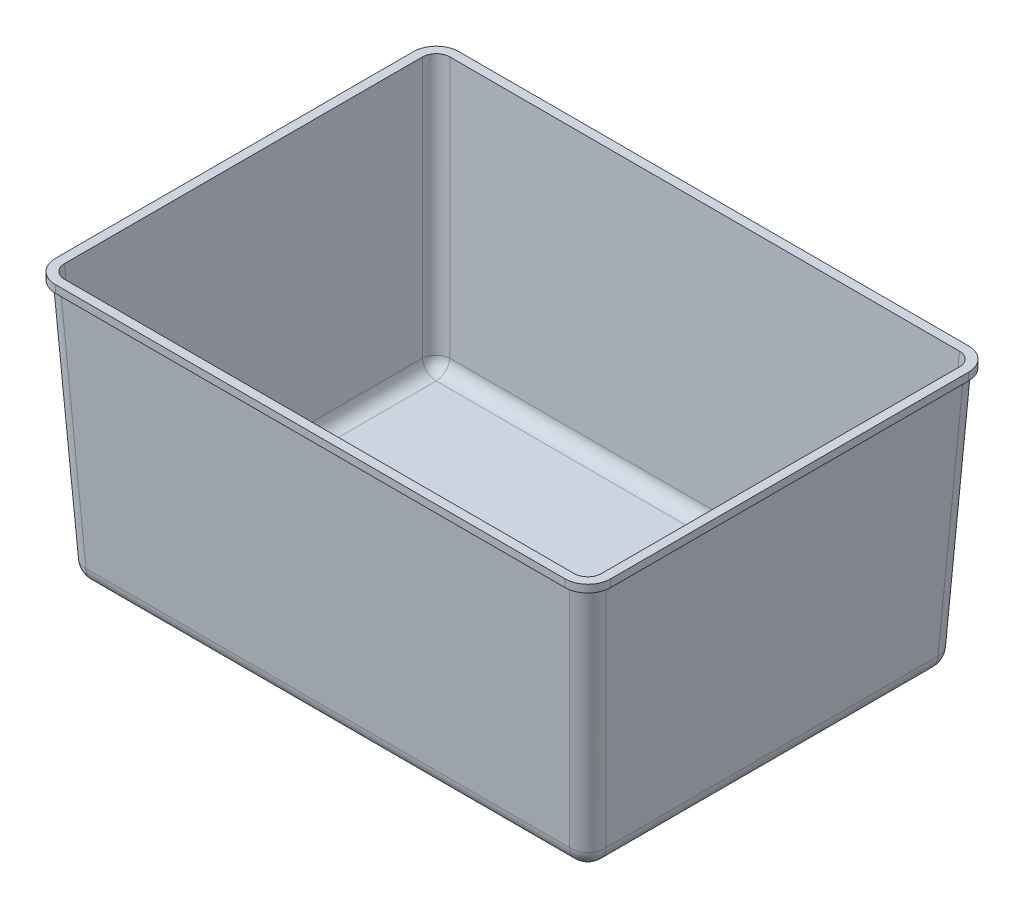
ISO-10303-21;
HEADER;
FILE_DESCRIPTION(('STEP AP214'),'2;1');
FILE_NAME('part.step','',(''),(''),'','','');
FILE_SCHEMA(('AUTOMOTIVE_DESIGN { 1 0 10303 214 1 1 1 1 }'));
ENDSEC;
DATA;
#1=APPLICATION_CONTEXT('core data for automotive mechanical design processes');
#2=APPLICATION_PROTOCOL_DEFINITION('international standard','automotive_design',2000,#1);
#3=PRODUCT_CONTEXT('',#1,'mechanical');
#4=PRODUCT('Part','Part','',(#3));
#5=PRODUCT_RELATED_PRODUCT_CATEGORY('part','',(#4));
#6=PRODUCT_DEFINITION_FORMATION('','',#4);
#7=PRODUCT_DEFINITION_CONTEXT('part definition',#1,'design');
#8=PRODUCT_DEFINITION('design','',#6,#7);
#9=PRODUCT_DEFINITION_SHAPE('','',#8);
#10=(LENGTH_UNIT() NAMED_UNIT(*) SI_UNIT(.MILLI.,.METRE.));
#11=(NAMED_UNIT(*) PLANE_ANGLE_UNIT() SI_UNIT($,.RADIAN.));
#12=(NAMED_UNIT(*) SI_UNIT($,.STERADIAN.) SOLID_ANGLE_UNIT());
#13=UNCERTAINTY_MEASURE_WITH_UNIT(LENGTH_MEASURE(1.E-05),#10,'distance_accuracy_value','');
#14=(GEOMETRIC_REPRESENTATION_CONTEXT(3) GLOBAL_UNCERTAINTY_ASSIGNED_CONTEXT((#13)) GLOBAL_UNIT_ASSIGNED_CONTEXT((#10,
#11,#12)) REPRESENTATION_CONTEXT('',''));
#15=CARTESIAN_POINT('',(0.,0.,0.));
#16=DIRECTION('',(0.,0.,1.));
#17=DIRECTION('',(1.,0.,0.));
#18=AXIS2_PLACEMENT_3D('',#15,#16,#17);
#19=CARTESIAN_POINT('',(0.,0.,-260.));
#20=DIRECTION('',(0.,-1.,0.));
#21=DIRECTION('',(0.,0.,-1.));
#22=AXIS2_PLACEMENT_3D('',#19,#20,#21);
#23=PLANE('',#22);
#24=DIRECTION('',(0.,0.,-1.));
#25=VECTOR('',#24,1.);
#26=CARTESIAN_POINT('',(356.995882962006,0.,0.));
#27=LINE('',#26,#25);
#28=CARTESIAN_POINT('',(356.995882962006,0.,-11.9917828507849));
#29=VERTEX_POINT('',#28);
#30=CARTESIAN_POINT('',(356.995882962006,0.,-248.008217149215));
#31=VERTEX_POINT('',#30);
#32=EDGE_CURVE('E541',#29,#31,#27,.T.);
#33=ORIENTED_EDGE('',*,*,#32,.F.);
#34=CARTESIAN_POINT('',(347.983531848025,0.,-12.016468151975));
#35=DIRECTION('',(0.,-1.,0.));
#36=DIRECTION('',(0.707106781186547,0.,0.707106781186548));
#37=AXIS2_PLACEMENT_3D('',#34,#35,#36);
#38=ELLIPSE('',#37,9.0246853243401,9.);
#39=CARTESIAN_POINT('',(348.008217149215,0.,-3.00411703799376));
#40=VERTEX_POINT('',#39);
#41=EDGE_CURVE('E539',#40,#29,#38,.F.);
#42=ORIENTED_EDGE('',*,*,#41,.F.);
#43=DIRECTION('',(1.,0.,0.));
#44=VECTOR('',#43,1.);
#45=CARTESIAN_POINT('',(0.,0.,-3.00411703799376));
#46=LINE('',#45,#44);
#47=CARTESIAN_POINT('',(11.9917828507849,0.,-3.00411703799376));
#48=VERTEX_POINT('',#47);
#49=EDGE_CURVE('E536',#48,#40,#46,.T.);
#50=ORIENTED_EDGE('',*,*,#49,.F.);
#51=CARTESIAN_POINT('',(12.0164681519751,0.,-12.016468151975));
#52=DIRECTION('',(0.,-1.,0.));
#53=DIRECTION('',(-0.707106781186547,0.,0.707106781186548));
#54=AXIS2_PLACEMENT_3D('',#51,#52,#53);
#55=ELLIPSE('',#54,9.0246853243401,9.);
#56=CARTESIAN_POINT('',(3.00411703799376,0.,-11.9917828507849));
#57=VERTEX_POINT('',#56);
#58=EDGE_CURVE('E537',#57,#48,#55,.F.);
#59=ORIENTED_EDGE('',*,*,#58,.F.);
#60=DIRECTION('',(0.,0.,1.));
#61=VECTOR('',#60,1.);
#62=CARTESIAN_POINT('',(3.00411703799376,0.,0.));
#63=LINE('',#62,#61);
#64=CARTESIAN_POINT('',(3.00411703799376,0.,-248.008217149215));
#65=VERTEX_POINT('',#64);
#66=EDGE_CURVE('E494',#65,#57,#63,.T.);
#67=ORIENTED_EDGE('',*,*,#66,.F.);
#68=CARTESIAN_POINT('',(12.0164681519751,0.,-247.983531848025));
#69=DIRECTION('',(0.,-1.,0.));
#70=DIRECTION('',(-0.707106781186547,0.,-0.707106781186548));
#71=AXIS2_PLACEMENT_3D('',#68,#69,#70);
#72=ELLIPSE('',#71,9.0246853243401,9.);
#73=CARTESIAN_POINT('',(11.9917828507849,0.,-256.995882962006));
#74=VERTEX_POINT('',#73);
#75=EDGE_CURVE('E491',#74,#65,#72,.F.);
#76=ORIENTED_EDGE('',*,*,#75,.F.);
#77=DIRECTION('',(-1.,0.,0.));
#78=VECTOR('',#77,1.);
#79=CARTESIAN_POINT('',(0.,0.,-256.995882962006));
#80=LINE('',#79,#78);
#81=CARTESIAN_POINT('',(348.008217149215,0.,-256.995882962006));
#82=VERTEX_POINT('',#81);
#83=EDGE_CURVE('E521',#82,#74,#80,.T.);
#84=ORIENTED_EDGE('',*,*,#83,.F.);
#85=CARTESIAN_POINT('',(347.983531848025,0.,-247.983531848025));
#86=DIRECTION('',(0.,-1.,0.));
#87=DIRECTION('',(0.707106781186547,0.,-0.707106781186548));
#88=AXIS2_PLACEMENT_3D('',#85,#86,#87);
#89=ELLIPSE('',#88,9.0246853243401,9.);
#90=EDGE_CURVE('E477',#31,#82,#89,.F.);
#91=ORIENTED_EDGE('',*,*,#90,.F.);
#92=EDGE_LOOP('',(#33,#42,#50,#59,#67,#76,#84,#91));
#93=FACE_BOUND('',#92,.T.);
#94=CARTESIAN_POINT('',(363.,0.,-11.9835544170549));
#95=CARTESIAN_POINT('',(363.,0.,-10.9943958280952));
#96=CARTESIAN_POINT('',(362.903206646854,0.,-10.0176261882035));
#97=CARTESIAN_POINT('',(362.615119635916,0.,-8.57076165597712));
#98=CARTESIAN_POINT('',(362.494318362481,0.,-8.08937501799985));
#99=CARTESIAN_POINT('',(362.208283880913,0.,-7.14870270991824));
#100=CARTESIAN_POINT('',(362.043088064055,0.,-6.68835549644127));
#101=CARTESIAN_POINT('',(361.482464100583,0.,-5.33660545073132));
#102=CARTESIAN_POINT('',(361.022635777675,0.,-4.47420761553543));
#103=CARTESIAN_POINT('',(359.9236283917,0.,-2.83018917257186));
#104=CARTESIAN_POINT('',(359.301766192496,0.,-2.0747607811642));
#105=CARTESIAN_POINT('',(358.267024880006,0.,-1.04030655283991));
#106=CARTESIAN_POINT('',(357.904878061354,0.,-0.711885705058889));
#107=CARTESIAN_POINT('',(357.145360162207,0.,-0.0885598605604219));
#108=CARTESIAN_POINT('',(356.746386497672,0.,0.207136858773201));
#109=CARTESIAN_POINT('',(355.521556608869,0.,1.02454261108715));
#110=CARTESIAN_POINT('',(354.661187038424,0.,1.48374052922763));
#111=CARTESIAN_POINT('',(353.305655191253,0.,2.04539020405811));
#112=CARTESIAN_POINT('',(352.841696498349,0.,2.21162740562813));
#113=CARTESIAN_POINT('',(351.896355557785,0.,2.49822231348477));
#114=CARTESIAN_POINT('',(351.419967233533,0.,2.61720086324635));
#115=CARTESIAN_POINT('',(349.979959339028,0.,2.90321173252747));
#116=CARTESIAN_POINT('',(349.005600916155,0.,3.00000000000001));
#117=CARTESIAN_POINT('',(348.016445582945,0.,3.));
#118=B_SPLINE_CURVE_WITH_KNOTS('',3,(#94,#95,#96,#97,#98,#99,#100,#101,#102,#103,#104,#105,#106,
#107,#108,#109,#110,#111,#112,#113,#114,#115,#116,#117),.UNSPECIFIED.,.F.,.F.,(4,2,2,2,2,2,2,2,
2,2,2,4),(0.,0.125000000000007,0.187500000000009,0.250000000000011,0.375000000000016,
0.500000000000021,0.562500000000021,0.625000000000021,0.75000000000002,0.812500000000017,
0.875000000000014,1.),.UNSPECIFIED.);
#119=CARTESIAN_POINT('',(348.016445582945,0.,3.));
#120=VERTEX_POINT('',#119);
#121=CARTESIAN_POINT('',(363.,0.,-11.9835544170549));
#122=VERTEX_POINT('',#121);
#123=EDGE_CURVE('E221',#120,#122,#118,.F.);
#124=ORIENTED_EDGE('',*,*,#123,.T.);
#125=DIRECTION('',(0.,0.,-1.));
#126=VECTOR('',#125,1.);
#127=CARTESIAN_POINT('',(363.,0.,-11.9835544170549));
#128=LINE('',#127,#126);
#129=CARTESIAN_POINT('',(363.,0.,-248.016445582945));
#130=VERTEX_POINT('',#129);
#131=EDGE_CURVE('E234',#122,#130,#128,.T.);
#132=ORIENTED_EDGE('',*,*,#131,.T.);
#133=CARTESIAN_POINT('',(348.016445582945,0.,-263.));
#134=CARTESIAN_POINT('',(349.005604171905,0.,-263.));
#135=CARTESIAN_POINT('',(349.982373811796,0.,-262.903206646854));
#136=CARTESIAN_POINT('',(351.429238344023,0.,-262.615119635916));
#137=CARTESIAN_POINT('',(351.910624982,0.,-262.494318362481));
#138=CARTESIAN_POINT('',(352.851297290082,0.,-262.208283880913));
#139=CARTESIAN_POINT('',(353.311644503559,0.,-262.043088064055));
#140=CARTESIAN_POINT('',(354.663394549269,0.,-261.482464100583));
#141=CARTESIAN_POINT('',(355.525792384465,0.,-261.022635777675));
#142=CARTESIAN_POINT('',(357.169810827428,0.,-259.9236283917));
#143=CARTESIAN_POINT('',(357.925239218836,0.,-259.301766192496));
#144=CARTESIAN_POINT('',(358.95969344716,0.,-258.267024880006));
#145=CARTESIAN_POINT('',(359.288114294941,0.,-257.904878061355));
#146=CARTESIAN_POINT('',(359.911440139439,0.,-257.145360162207));
#147=CARTESIAN_POINT('',(360.207136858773,0.,-256.746386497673));
#148=CARTESIAN_POINT('',(361.024542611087,0.,-255.521556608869));
#149=CARTESIAN_POINT('',(361.483740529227,0.,-254.661187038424));
#150=CARTESIAN_POINT('',(362.045390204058,0.,-253.305655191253));
#151=CARTESIAN_POINT('',(362.211627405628,0.,-252.841696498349));
#152=CARTESIAN_POINT('',(362.498222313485,0.,-251.896355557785));
#153=CARTESIAN_POINT('',(362.617200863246,0.,-251.419967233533));
#154=CARTESIAN_POINT('',(362.903211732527,0.,-249.979959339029));
#155=CARTESIAN_POINT('',(363.,0.,-249.005600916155));
#156=CARTESIAN_POINT('',(363.,0.,-248.016445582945));
#157=B_SPLINE_CURVE_WITH_KNOTS('',3,(#133,#134,#135,#136,#137,#138,#139,#140,#141,#142,#143,
#144,#145,#146,#147,#148,#149,#150,#151,#152,#153,#154,#155,#156),.UNSPECIFIED.,.F.,.F.,(4,2,2,
2,2,2,2,2,2,2,2,4),(0.,0.125000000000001,0.187500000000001,0.250000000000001,0.375000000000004,
0.500000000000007,0.562500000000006,0.625000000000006,0.750000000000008,0.812500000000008,
0.875000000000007,1.),.UNSPECIFIED.);
#158=CARTESIAN_POINT('',(348.016445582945,0.,-263.));
#159=VERTEX_POINT('',#158);
#160=EDGE_CURVE('E239',#130,#159,#157,.F.);
#161=ORIENTED_EDGE('',*,*,#160,.T.);
#162=DIRECTION('',(-1.,0.,0.));
#163=VECTOR('',#162,1.);
#164=CARTESIAN_POINT('',(348.016445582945,0.,-263.));
#165=LINE('',#164,#163);
#166=CARTESIAN_POINT('',(11.9835544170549,0.,-263.));
#167=VERTEX_POINT('',#166);
#168=EDGE_CURVE('E367',#159,#167,#165,.T.);
#169=ORIENTED_EDGE('',*,*,#168,.T.);
#170=CARTESIAN_POINT('',(-2.99999999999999,0.,-248.016445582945));
#171=CARTESIAN_POINT('',(-2.99999999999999,0.,-249.005604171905));
#172=CARTESIAN_POINT('',(-2.90320664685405,0.,-249.982373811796));
#173=CARTESIAN_POINT('',(-2.61511963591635,0.,-251.429238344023));
#174=CARTESIAN_POINT('',(-2.49431836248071,0.,-251.910624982));
#175=CARTESIAN_POINT('',(-2.20828388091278,0.,-252.851297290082));
#176=CARTESIAN_POINT('',(-2.04308806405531,0.,-253.311644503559));
#177=CARTESIAN_POINT('',(-1.48246410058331,0.,-254.663394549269));
#178=CARTESIAN_POINT('',(-1.02263577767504,0.,-255.525792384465));
#179=CARTESIAN_POINT('',(0.0763716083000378,0.,-257.169810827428));
#180=CARTESIAN_POINT('',(0.698233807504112,0.,-257.925239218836));
#181=CARTESIAN_POINT('',(1.73297511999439,0.,-258.95969344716));
#182=CARTESIAN_POINT('',(2.09512193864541,0.,-259.288114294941));
#183=CARTESIAN_POINT('',(2.85463983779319,0.,-259.911440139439));
#184=CARTESIAN_POINT('',(3.25361350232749,0.,-260.207136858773));
#185=CARTESIAN_POINT('',(4.47844339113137,0.,-261.024542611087));
#186=CARTESIAN_POINT('',(5.33881296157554,0.,-261.483740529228));
#187=CARTESIAN_POINT('',(6.69434480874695,0.,-262.045390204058));
#188=CARTESIAN_POINT('',(7.15830350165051,0.,-262.211627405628));
#189=CARTESIAN_POINT('',(8.10364444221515,0.,-262.498222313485));
#190=CARTESIAN_POINT('',(8.58003276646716,0.,-262.617200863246));
#191=CARTESIAN_POINT('',(10.0200406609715,0.,-262.903211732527));
#192=CARTESIAN_POINT('',(10.9943990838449,0.,-263.));
#193=CARTESIAN_POINT('',(11.9835544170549,0.,-263.));
#194=B_SPLINE_CURVE_WITH_KNOTS('',3,(#170,#171,#172,#173,#174,#175,#176,#177,#178,#179,#180,
#181,#182,#183,#184,#185,#186,#187,#188,#189,#190,#191,#192,#193),.UNSPECIFIED.,.F.,.F.,(4,2,2,
2,2,2,2,2,2,2,2,4),(0.,0.124999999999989,0.187499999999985,0.249999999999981,0.37499999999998,
0.499999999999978,0.56249999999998,0.624999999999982,0.74999999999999,0.812499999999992,
0.874999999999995,1.),.UNSPECIFIED.);
#195=CARTESIAN_POINT('',(-2.99999999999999,0.,-248.016445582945));
#196=VERTEX_POINT('',#195);
#197=EDGE_CURVE('E366',#167,#196,#194,.F.);
#198=ORIENTED_EDGE('',*,*,#197,.T.);
#199=DIRECTION('',(0.,0.,1.));
#200=VECTOR('',#199,1.);
#201=CARTESIAN_POINT('',(-2.99999999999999,0.,-248.016445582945));
#202=LINE('',#201,#200);
#203=CARTESIAN_POINT('',(-3.,0.,-11.9835544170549));
#204=VERTEX_POINT('',#203);
#205=EDGE_CURVE('E285',#196,#204,#202,.T.);
#206=ORIENTED_EDGE('',*,*,#205,.T.);
#207=CARTESIAN_POINT('',(11.9835544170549,0.,3.));
#208=CARTESIAN_POINT('',(10.9943958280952,0.,3.));
#209=CARTESIAN_POINT('',(10.0176261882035,0.,2.90320664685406));
#210=CARTESIAN_POINT('',(8.57076165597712,0.,2.61511963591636));
#211=CARTESIAN_POINT('',(8.08937501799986,0.,2.49431836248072));
#212=CARTESIAN_POINT('',(7.14870270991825,0.,2.20828388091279));
#213=CARTESIAN_POINT('',(6.68835549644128,0.,2.04308806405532));
#214=CARTESIAN_POINT('',(5.33660545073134,0.,1.48246410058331));
#215=CARTESIAN_POINT('',(4.47420761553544,0.,1.02263577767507));
#216=CARTESIAN_POINT('',(2.83018917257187,0.,-0.0763716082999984));
#217=CARTESIAN_POINT('',(2.07476078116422,0.,-0.698233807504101));
#218=CARTESIAN_POINT('',(1.04030655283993,0.,-1.73297511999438));
#219=CARTESIAN_POINT('',(0.711885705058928,0.,-2.0951219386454));
#220=CARTESIAN_POINT('',(0.0885598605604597,0.,-2.85463983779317));
#221=CARTESIAN_POINT('',(-0.207136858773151,0.,-3.25361350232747));
#222=CARTESIAN_POINT('',(-1.0245426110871,0.,-4.47844339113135));
#223=CARTESIAN_POINT('',(-1.48374052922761,0.,-5.33881296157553));
#224=CARTESIAN_POINT('',(-2.04539020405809,0.,-6.69434480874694));
#225=CARTESIAN_POINT('',(-2.21162740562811,0.,-7.1583035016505));
#226=CARTESIAN_POINT('',(-2.49822231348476,0.,-8.10364444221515));
#227=CARTESIAN_POINT('',(-2.61720086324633,0.,-8.58003276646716));
#228=CARTESIAN_POINT('',(-2.90321173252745,0.,-10.0200406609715));
#229=CARTESIAN_POINT('',(-3.,0.,-10.9943990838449));
#230=CARTESIAN_POINT('',(-3.,0.,-11.9835544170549));
#231=B_SPLINE_CURVE_WITH_KNOTS('',3,(#207,#208,#209,#210,#211,#212,#213,#214,#215,#216,#217,
#218,#219,#220,#221,#222,#223,#224,#225,#226,#227,#228,#229,#230),.UNSPECIFIED.,.F.,.F.,(4,2,2,
2,2,2,2,2,2,2,2,4),(0.,0.125,0.1875,0.25,0.375,0.5,0.5625,0.625,0.75,0.8125,0.875,1.),.UNSPECIFIED.);
#232=CARTESIAN_POINT('',(11.9835544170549,0.,3.));
#233=VERTEX_POINT('',#232);
#234=EDGE_CURVE('E283',#204,#233,#231,.F.);
#235=ORIENTED_EDGE('',*,*,#234,.T.);
#236=DIRECTION('',(1.,0.,0.));
#237=VECTOR('',#236,1.);
#238=CARTESIAN_POINT('',(11.9835544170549,0.,3.));
#239=LINE('',#238,#237);
#240=EDGE_CURVE('E244',#233,#120,#239,.T.);
#241=ORIENTED_EDGE('',*,*,#240,.T.);
#242=EDGE_LOOP('',(#124,#132,#161,#169,#198,#206,#235,#241));
#243=FACE_BOUND('',#242,.T.);
#244=ADVANCED_FACE('F26',(#93,#243),#23,.F.);
#245=CARTESIAN_POINT('',(2.99588860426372,0.157007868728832,0.));
#246=DIRECTION('',(-0.998629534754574,-0.0523359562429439,0.));
#247=DIRECTION('',(0.052335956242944,-0.998629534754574,0.));
#248=AXIS2_PLACEMENT_3D('',#245,#246,#247);
#249=PLANE('',#248);
#250=DIRECTION('',(0.,0.,1.));
#251=VECTOR('',#250,1.);
#252=CARTESIAN_POINT('',(11.5712703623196,-163.471023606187,0.));
#253=LINE('',#252,#251);
#254=CARTESIAN_POINT('',(11.5712703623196,-163.471023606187,-239.441063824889));
#255=VERTEX_POINT('',#254);
#256=CARTESIAN_POINT('',(11.5712703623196,-163.471023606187,-20.5589361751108));
#257=VERTEX_POINT('',#256);
#258=EDGE_CURVE('E461',#255,#257,#253,.T.);
#259=ORIENTED_EDGE('',*,*,#258,.F.);
#260=DIRECTION('',(-0.052264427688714,0.997264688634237,-0.052264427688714));
#261=VECTOR('',#260,1.);
#262=CARTESIAN_POINT('',(2.96315468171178,0.781608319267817,-248.049179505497));
#263=LINE('',#262,#261);
#264=EDGE_CURVE('E464',#65,#255,#263,.F.);
#265=ORIENTED_EDGE('',*,*,#264,.F.);
#266=ORIENTED_EDGE('',*,*,#66,.T.);
#267=DIRECTION('',(-0.052264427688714,0.997264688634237,0.052264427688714));
#268=VECTOR('',#267,1.);
#269=CARTESIAN_POINT('',(2.96315468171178,0.781608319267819,-11.950820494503));
#270=LINE('',#269,#268);
#271=EDGE_CURVE('E463',#257,#57,#270,.T.);
#272=ORIENTED_EDGE('',*,*,#271,.F.);
#273=EDGE_LOOP('',(#259,#265,#266,#272));
#274=FACE_BOUND('',#273,.T.);
#275=ADVANCED_FACE('F260',(#274),#249,.F.);
#276=CARTESIAN_POINT('',(0.,0.157007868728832,-257.004111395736));
#277=DIRECTION('',(0.,-0.0523359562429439,-0.998629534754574));
#278=DIRECTION('',(0.,0.998629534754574,-0.052335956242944));
#279=AXIS2_PLACEMENT_3D('',#276,#277,#278);
#280=PLANE('',#279);
#281=ORIENTED_EDGE('',*,*,#83,.T.);
#282=DIRECTION('',(-0.052264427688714,0.997264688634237,-0.052264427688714));
#283=VECTOR('',#282,1.);
#284=CARTESIAN_POINT('',(11.950820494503,0.781608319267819,-257.036845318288));
#285=LINE('',#284,#283);
#286=CARTESIAN_POINT('',(20.5589361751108,-163.471023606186,-248.42872963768));
#287=VERTEX_POINT('',#286);
#288=EDGE_CURVE('E518',#287,#74,#285,.T.);
#289=ORIENTED_EDGE('',*,*,#288,.F.);
#290=DIRECTION('',(1.,0.,0.));
#291=VECTOR('',#290,1.);
#292=CARTESIAN_POINT('',(0.,-163.471023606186,-248.42872963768));
#293=LINE('',#292,#291);
#294=CARTESIAN_POINT('',(339.441063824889,-163.471023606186,-248.42872963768));
#295=VERTEX_POINT('',#294);
#296=EDGE_CURVE('E520',#295,#287,#293,.F.);
#297=ORIENTED_EDGE('',*,*,#296,.F.);
#298=DIRECTION('',(0.052264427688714,0.997264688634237,-0.052264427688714));
#299=VECTOR('',#298,1.);
#300=CARTESIAN_POINT('',(347.338971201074,-12.7699734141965,-256.326637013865));
#301=LINE('',#300,#299);
#302=EDGE_CURVE('E502',#82,#295,#301,.F.);
#303=ORIENTED_EDGE('',*,*,#302,.F.);
#304=EDGE_LOOP('',(#281,#289,#297,#303));
#305=FACE_BOUND('',#304,.T.);
#306=ADVANCED_FACE('F878',(#305),#280,.F.);
#307=CARTESIAN_POINT('',(357.004111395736,0.157007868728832,0.));
#308=DIRECTION('',(0.998629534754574,-0.0523359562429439,0.));
#309=DIRECTION('',(0.052335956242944,0.998629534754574,0.));
#310=AXIS2_PLACEMENT_3D('',#307,#308,#309);
#311=PLANE('',#310);
#312=DIRECTION('',(0.,0.,1.));
#313=VECTOR('',#312,1.);
#314=CARTESIAN_POINT('',(348.42872963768,-163.471023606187,0.));
#315=LINE('',#314,#313);
#316=CARTESIAN_POINT('',(348.42872963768,-163.471023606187,-20.5589361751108));
#317=VERTEX_POINT('',#316);
#318=CARTESIAN_POINT('',(348.42872963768,-163.471023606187,-239.441063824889));
#319=VERTEX_POINT('',#318);
#320=EDGE_CURVE('E486',#317,#319,#315,.F.);
#321=ORIENTED_EDGE('',*,*,#320,.F.);
#322=DIRECTION('',(0.052264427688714,0.997264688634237,0.052264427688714));
#323=VECTOR('',#322,1.);
#324=CARTESIAN_POINT('',(356.053479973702,-17.9821202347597,-12.9341858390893));
#325=LINE('',#324,#323);
#326=EDGE_CURVE('E484',#29,#317,#325,.F.);
#327=ORIENTED_EDGE('',*,*,#326,.F.);
#328=ORIENTED_EDGE('',*,*,#32,.T.);
#329=DIRECTION('',(0.052264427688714,0.997264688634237,-0.052264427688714));
#330=VECTOR('',#329,1.);
#331=CARTESIAN_POINT('',(356.326637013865,-12.7699734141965,-247.338971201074));
#332=LINE('',#331,#330);
#333=EDGE_CURVE('E489',#319,#31,#332,.T.);
#334=ORIENTED_EDGE('',*,*,#333,.F.);
#335=EDGE_LOOP('',(#321,#327,#328,#334));
#336=FACE_BOUND('',#335,.T.);
#337=ADVANCED_FACE('F870',(#336),#311,.F.);
#338=CARTESIAN_POINT('',(0.,0.157007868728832,-2.99588860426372));
#339=DIRECTION('',(0.,-0.0523359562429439,0.998629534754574));
#340=DIRECTION('',(0.,-0.998629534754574,-0.052335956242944));
#341=AXIS2_PLACEMENT_3D('',#338,#339,#340);
#342=PLANE('',#341);
#343=DIRECTION('',(1.,0.,0.));
#344=VECTOR('',#343,1.);
#345=CARTESIAN_POINT('',(0.,-163.471023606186,-11.5712703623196));
#346=LINE('',#345,#344);
#347=CARTESIAN_POINT('',(20.5589361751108,-163.471023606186,-11.5712703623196));
#348=VERTEX_POINT('',#347);
#349=CARTESIAN_POINT('',(339.441063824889,-163.471023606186,-11.5712703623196));
#350=VERTEX_POINT('',#349);
#351=EDGE_CURVE('E476',#348,#350,#346,.T.);
#352=ORIENTED_EDGE('',*,*,#351,.F.);
#353=DIRECTION('',(-0.052264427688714,0.997264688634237,0.052264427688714));
#354=VECTOR('',#353,1.);
#355=CARTESIAN_POINT('',(11.9508204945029,0.781608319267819,-2.96315468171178));
#356=LINE('',#355,#354);
#357=EDGE_CURVE('E474',#48,#348,#356,.F.);
#358=ORIENTED_EDGE('',*,*,#357,.F.);
#359=ORIENTED_EDGE('',*,*,#49,.T.);
#360=DIRECTION('',(0.052264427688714,0.997264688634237,0.052264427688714));
#361=VECTOR('',#360,1.);
#362=CARTESIAN_POINT('',(347.065814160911,-17.9821202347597,-3.94652002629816));
#363=LINE('',#362,#361);
#364=EDGE_CURVE('E468',#350,#40,#363,.T.);
#365=ORIENTED_EDGE('',*,*,#364,.F.);
#366=EDGE_LOOP('',(#352,#358,#359,#365));
#367=FACE_BOUND('',#366,.T.);
#368=ADVANCED_FACE('F862',(#367),#342,.F.);
#369=CARTESIAN_POINT('',(0.,-172.,-260.));
#370=DIRECTION('',(0.,-1.,0.));
#371=DIRECTION('',(0.,0.,-1.));
#372=AXIS2_PLACEMENT_3D('',#369,#370,#371);
#373=PLANE('',#372);
#374=DIRECTION('',(0.,0.,-1.));
#375=VECTOR('',#374,1.);
#376=CARTESIAN_POINT('',(20.5589361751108,-172.,-260.));
#377=LINE('',#376,#375);
#378=CARTESIAN_POINT('',(20.5589361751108,-172.,-20.5589361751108));
#379=VERTEX_POINT('',#378);
#380=CARTESIAN_POINT('',(20.5589361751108,-172.,-239.441063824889));
#381=VERTEX_POINT('',#380);
#382=EDGE_CURVE('E499',#379,#381,#377,.T.);
#383=ORIENTED_EDGE('',*,*,#382,.F.);
#384=DIRECTION('',(1.,0.,0.));
#385=VECTOR('',#384,1.);
#386=CARTESIAN_POINT('',(0.,-172.,-20.5589361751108));
#387=LINE('',#386,#385);
#388=CARTESIAN_POINT('',(339.441063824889,-172.,-20.5589361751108));
#389=VERTEX_POINT('',#388);
#390=EDGE_CURVE('E501',#389,#379,#387,.F.);
#391=ORIENTED_EDGE('',*,*,#390,.F.);
#392=DIRECTION('',(0.,0.,-1.));
#393=VECTOR('',#392,1.);
#394=CARTESIAN_POINT('',(339.441063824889,-172.,-260.));
#395=LINE('',#394,#393);
#396=CARTESIAN_POINT('',(339.441063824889,-172.,-239.441063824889));
#397=VERTEX_POINT('',#396);
#398=EDGE_CURVE('E505',#397,#389,#395,.F.);
#399=ORIENTED_EDGE('',*,*,#398,.F.);
#400=DIRECTION('',(1.,0.,0.));
#401=VECTOR('',#400,1.);
#402=CARTESIAN_POINT('',(0.,-172.,-239.441063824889));
#403=LINE('',#402,#401);
#404=EDGE_CURVE('E487',#381,#397,#403,.T.);
#405=ORIENTED_EDGE('',*,*,#404,.F.);
#406=EDGE_LOOP('',(#383,#391,#399,#405));
#407=FACE_BOUND('',#406,.T.);
#408=ADVANCED_FACE('F854',(#407),#373,.F.);
#409=CARTESIAN_POINT('',(347.065814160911,-17.5110966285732,-12.9341858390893));
#410=DIRECTION('',(0.052264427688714,0.997264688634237,0.052264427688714));
#411=DIRECTION('',(0.,-0.052335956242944,0.998629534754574));
#412=AXIS2_PLACEMENT_3D('',#409,#410,#411);
#413=CYLINDRICAL_SURFACE('',#412,9.);
#414=ORIENTED_EDGE('',*,*,#41,.T.);
#415=ORIENTED_EDGE('',*,*,#326,.T.);
#416=CARTESIAN_POINT('',(339.441063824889,-163.,-20.5589361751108));
#417=DIRECTION('',(0.052264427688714,0.997264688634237,0.052264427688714));
#418=DIRECTION('',(0.,-0.052335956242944,0.998629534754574));
#419=AXIS2_PLACEMENT_3D('',#416,#417,#418);
#420=CIRCLE('',#419,9.);
#421=EDGE_CURVE('E472',#317,#350,#420,.F.);
#422=ORIENTED_EDGE('',*,*,#421,.T.);
#423=ORIENTED_EDGE('',*,*,#364,.T.);
#424=EDGE_LOOP('',(#414,#415,#422,#423));
#425=FACE_BOUND('',#424,.T.);
#426=ADVANCED_FACE('F846',(#425),#413,.F.);
#427=CARTESIAN_POINT('',(11.9508204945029,1.25263192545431,-11.9508204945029));
#428=DIRECTION('',(-0.052264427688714,0.997264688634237,0.052264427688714));
#429=DIRECTION('',(0.,-0.052335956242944,0.998629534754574));
#430=AXIS2_PLACEMENT_3D('',#427,#428,#429);
#431=CYLINDRICAL_SURFACE('',#430,9.);
#432=ORIENTED_EDGE('',*,*,#58,.T.);
#433=ORIENTED_EDGE('',*,*,#357,.T.);
#434=CARTESIAN_POINT('',(20.5589361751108,-163.,-20.5589361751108));
#435=DIRECTION('',(-0.052264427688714,0.997264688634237,0.052264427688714));
#436=DIRECTION('',(0.,-0.052335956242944,0.998629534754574));
#437=AXIS2_PLACEMENT_3D('',#434,#435,#436);
#438=CIRCLE('',#437,9.);
#439=EDGE_CURVE('E469',#348,#257,#438,.F.);
#440=ORIENTED_EDGE('',*,*,#439,.T.);
#441=ORIENTED_EDGE('',*,*,#271,.T.);
#442=EDGE_LOOP('',(#432,#433,#440,#441));
#443=FACE_BOUND('',#442,.T.);
#444=ADVANCED_FACE('F838',(#443),#431,.F.);
#445=CARTESIAN_POINT('',(0.,-163.,-20.5589361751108));
#446=DIRECTION('',(1.,0.,0.));
#447=DIRECTION('',(0.,0.,-1.));
#448=AXIS2_PLACEMENT_3D('',#445,#446,#447);
#449=CYLINDRICAL_SURFACE('',#448,9.);
#450=CARTESIAN_POINT('',(339.441063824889,-163.,-20.5589361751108));
#451=DIRECTION('',(-1.,0.,0.));
#452=DIRECTION('',(0.,-1.,0.));
#453=AXIS2_PLACEMENT_3D('',#450,#451,#452);
#454=CIRCLE('',#453,9.);
#455=EDGE_CURVE('E483',#350,#389,#454,.F.);
#456=ORIENTED_EDGE('',*,*,#455,.T.);
#457=ORIENTED_EDGE('',*,*,#390,.T.);
#458=CARTESIAN_POINT('',(20.5589361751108,-163.,-20.5589361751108));
#459=DIRECTION('',(-1.,0.,0.));
#460=DIRECTION('',(0.,-1.,0.));
#461=AXIS2_PLACEMENT_3D('',#458,#459,#460);
#462=CIRCLE('',#461,9.);
#463=EDGE_CURVE('E473',#379,#348,#462,.T.);
#464=ORIENTED_EDGE('',*,*,#463,.T.);
#465=ORIENTED_EDGE('',*,*,#351,.T.);
#466=EDGE_LOOP('',(#456,#457,#464,#465));
#467=FACE_BOUND('',#466,.T.);
#468=ADVANCED_FACE('F830',(#467),#449,.F.);
#469=CARTESIAN_POINT('',(339.441063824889,-163.,-20.5589361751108));
#470=DIRECTION('',(0.,0.,1.));
#471=DIRECTION('',(1.,0.,0.));
#472=AXIS2_PLACEMENT_3D('',#469,#470,#471);
#473=SPHERICAL_SURFACE('',#472,9.);
#474=ORIENTED_EDGE('',*,*,#421,.F.);
#475=CARTESIAN_POINT('',(339.441063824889,-163.,-20.5589361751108));
#476=DIRECTION('',(0.,0.,-1.));
#477=DIRECTION('',(-1.,0.,0.));
#478=AXIS2_PLACEMENT_3D('',#475,#476,#477);
#479=CIRCLE('',#478,9.);
#480=EDGE_CURVE('E495',#317,#389,#479,.T.);
#481=ORIENTED_EDGE('',*,*,#480,.T.);
#482=ORIENTED_EDGE('',*,*,#455,.F.);
#483=EDGE_LOOP('',(#474,#481,#482));
#484=FACE_BOUND('',#483,.T.);
#485=ADVANCED_FACE('F822',(#484),#473,.F.);
#486=CARTESIAN_POINT('',(20.5589361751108,-163.,-20.5589361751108));
#487=DIRECTION('',(0.,0.,1.));
#488=DIRECTION('',(1.,0.,0.));
#489=AXIS2_PLACEMENT_3D('',#486,#487,#488);
#490=SPHERICAL_SURFACE('',#489,9.);
#491=ORIENTED_EDGE('',*,*,#463,.F.);
#492=CARTESIAN_POINT('',(20.5589361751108,-163.,-20.5589361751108));
#493=DIRECTION('',(0.,0.,1.));
#494=DIRECTION('',(1.,0.,0.));
#495=AXIS2_PLACEMENT_3D('',#492,#493,#494);
#496=CIRCLE('',#495,9.);
#497=EDGE_CURVE('E498',#379,#257,#496,.F.);
#498=ORIENTED_EDGE('',*,*,#497,.T.);
#499=ORIENTED_EDGE('',*,*,#439,.F.);
#500=EDGE_LOOP('',(#491,#498,#499));
#501=FACE_BOUND('',#500,.T.);
#502=ADVANCED_FACE('F814',(#501),#490,.F.);
#503=CARTESIAN_POINT('',(339.441063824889,-163.,0.));
#504=DIRECTION('',(0.,0.,-1.));
#505=DIRECTION('',(-1.,0.,0.));
#506=AXIS2_PLACEMENT_3D('',#503,#504,#505);
#507=CYLINDRICAL_SURFACE('',#506,9.);
#508=ORIENTED_EDGE('',*,*,#480,.F.);
#509=ORIENTED_EDGE('',*,*,#320,.T.);
#510=CARTESIAN_POINT('',(339.441063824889,-163.,-239.441063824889));
#511=DIRECTION('',(0.,0.,1.));
#512=DIRECTION('',(1.,0.,0.));
#513=AXIS2_PLACEMENT_3D('',#510,#511,#512);
#514=CIRCLE('',#513,9.);
#515=EDGE_CURVE('E512',#319,#397,#514,.F.);
#516=ORIENTED_EDGE('',*,*,#515,.T.);
#517=ORIENTED_EDGE('',*,*,#398,.T.);
#518=EDGE_LOOP('',(#508,#509,#516,#517));
#519=FACE_BOUND('',#518,.T.);
#520=ADVANCED_FACE('F806',(#519),#507,.F.);
#521=CARTESIAN_POINT('',(347.338971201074,-12.29894980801,-247.338971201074));
#522=DIRECTION('',(0.052264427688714,0.997264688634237,-0.052264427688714));
#523=DIRECTION('',(0.,0.052335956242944,0.998629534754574));
#524=AXIS2_PLACEMENT_3D('',#521,#522,#523);
#525=CYLINDRICAL_SURFACE('',#524,9.);
#526=ORIENTED_EDGE('',*,*,#90,.T.);
#527=ORIENTED_EDGE('',*,*,#302,.T.);
#528=CARTESIAN_POINT('',(339.441063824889,-163.,-239.441063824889));
#529=DIRECTION('',(0.052264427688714,0.997264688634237,-0.052264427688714));
#530=DIRECTION('',(0.,0.052335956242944,0.998629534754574));
#531=AXIS2_PLACEMENT_3D('',#528,#529,#530);
#532=CIRCLE('',#531,9.);
#533=EDGE_CURVE('E524',#295,#319,#532,.F.);
#534=ORIENTED_EDGE('',*,*,#533,.T.);
#535=ORIENTED_EDGE('',*,*,#333,.T.);
#536=EDGE_LOOP('',(#526,#527,#534,#535));
#537=FACE_BOUND('',#536,.T.);
#538=ADVANCED_FACE('F798',(#537),#525,.F.);
#539=CARTESIAN_POINT('',(11.9508204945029,1.25263192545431,-248.049179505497));
#540=DIRECTION('',(-0.052264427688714,0.997264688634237,-0.052264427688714));
#541=DIRECTION('',(0.,0.052335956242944,0.998629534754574));
#542=AXIS2_PLACEMENT_3D('',#539,#540,#541);
#543=CYLINDRICAL_SURFACE('',#542,9.);
#544=ORIENTED_EDGE('',*,*,#75,.T.);
#545=ORIENTED_EDGE('',*,*,#264,.T.);
#546=CARTESIAN_POINT('',(20.5589361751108,-163.,-239.441063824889));
#547=DIRECTION('',(-0.052264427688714,0.997264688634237,-0.052264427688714));
#548=DIRECTION('',(0.,0.052335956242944,0.998629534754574));
#549=AXIS2_PLACEMENT_3D('',#546,#547,#548);
#550=CIRCLE('',#549,9.);
#551=EDGE_CURVE('E516',#255,#287,#550,.F.);
#552=ORIENTED_EDGE('',*,*,#551,.T.);
#553=ORIENTED_EDGE('',*,*,#288,.T.);
#554=EDGE_LOOP('',(#544,#545,#552,#553));
#555=FACE_BOUND('',#554,.T.);
#556=ADVANCED_FACE('F790',(#555),#543,.F.);
#557=CARTESIAN_POINT('',(20.5589361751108,-163.,0.));
#558=DIRECTION('',(0.,0.,1.));
#559=DIRECTION('',(1.,0.,0.));
#560=AXIS2_PLACEMENT_3D('',#557,#558,#559);
#561=CYLINDRICAL_SURFACE('',#560,9.);
#562=ORIENTED_EDGE('',*,*,#497,.F.);
#563=ORIENTED_EDGE('',*,*,#382,.T.);
#564=CARTESIAN_POINT('',(20.5589361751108,-163.,-239.441063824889));
#565=DIRECTION('',(0.,0.,1.));
#566=DIRECTION('',(1.,0.,0.));
#567=AXIS2_PLACEMENT_3D('',#564,#565,#566);
#568=CIRCLE('',#567,9.);
#569=EDGE_CURVE('E513',#381,#255,#568,.F.);
#570=ORIENTED_EDGE('',*,*,#569,.T.);
#571=ORIENTED_EDGE('',*,*,#258,.T.);
#572=EDGE_LOOP('',(#562,#563,#570,#571));
#573=FACE_BOUND('',#572,.T.);
#574=ADVANCED_FACE('F782',(#573),#561,.F.);
#575=CARTESIAN_POINT('',(339.441063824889,-163.,-239.441063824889));
#576=DIRECTION('',(0.,0.,1.));
#577=DIRECTION('',(1.,0.,0.));
#578=AXIS2_PLACEMENT_3D('',#575,#576,#577);
#579=SPHERICAL_SURFACE('',#578,9.);
#580=ORIENTED_EDGE('',*,*,#533,.F.);
#581=CARTESIAN_POINT('',(339.441063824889,-163.,-239.441063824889));
#582=DIRECTION('',(-1.,0.,0.));
#583=DIRECTION('',(0.,0.,1.));
#584=AXIS2_PLACEMENT_3D('',#581,#582,#583);
#585=CIRCLE('',#584,9.);
#586=EDGE_CURVE('E517',#295,#397,#585,.T.);
#587=ORIENTED_EDGE('',*,*,#586,.T.);
#588=ORIENTED_EDGE('',*,*,#515,.F.);
#589=EDGE_LOOP('',(#580,#587,#588));
#590=FACE_BOUND('',#589,.T.);
#591=ADVANCED_FACE('F774',(#590),#579,.F.);
#592=CARTESIAN_POINT('',(20.5589361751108,-163.,-239.441063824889));
#593=DIRECTION('',(0.,0.,1.));
#594=DIRECTION('',(1.,0.,0.));
#595=AXIS2_PLACEMENT_3D('',#592,#593,#594);
#596=SPHERICAL_SURFACE('',#595,9.);
#597=ORIENTED_EDGE('',*,*,#569,.F.);
#598=CARTESIAN_POINT('',(20.5589361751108,-163.,-239.441063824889));
#599=DIRECTION('',(-1.,0.,0.));
#600=DIRECTION('',(0.,0.,1.));
#601=AXIS2_PLACEMENT_3D('',#598,#599,#600);
#602=CIRCLE('',#601,9.);
#603=EDGE_CURVE('E460',#381,#287,#602,.F.);
#604=ORIENTED_EDGE('',*,*,#603,.T.);
#605=ORIENTED_EDGE('',*,*,#551,.F.);
#606=EDGE_LOOP('',(#597,#604,#605));
#607=FACE_BOUND('',#606,.T.);
#608=ADVANCED_FACE('F766',(#607),#596,.F.);
#609=CARTESIAN_POINT('',(0.,-163.,-239.441063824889));
#610=DIRECTION('',(-1.,0.,0.));
#611=DIRECTION('',(0.,0.,1.));
#612=AXIS2_PLACEMENT_3D('',#609,#610,#611);
#613=CYLINDRICAL_SURFACE('',#612,9.);
#614=ORIENTED_EDGE('',*,*,#586,.F.);
#615=ORIENTED_EDGE('',*,*,#296,.T.);
#616=ORIENTED_EDGE('',*,*,#603,.F.);
#617=ORIENTED_EDGE('',*,*,#404,.T.);
#618=EDGE_LOOP('',(#614,#615,#616,#617));
#619=FACE_BOUND('',#618,.T.);
#620=ADVANCED_FACE('F424',(#619),#613,.F.);
#621=CARTESIAN_POINT('',(348.016445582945,-5.,3.));
#622=CARTESIAN_POINT('',(349.005600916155,-5.,3.00000000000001));
#623=CARTESIAN_POINT('',(349.979959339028,-5.,2.90321173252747));
#624=CARTESIAN_POINT('',(351.419967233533,-5.,2.61720086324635));
#625=CARTESIAN_POINT('',(351.896355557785,-5.,2.49822231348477));
#626=CARTESIAN_POINT('',(352.841696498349,-5.,2.21162740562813));
#627=CARTESIAN_POINT('',(353.305655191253,-5.,2.04539020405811));
#628=CARTESIAN_POINT('',(354.661187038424,-5.,1.48374052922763));
#629=CARTESIAN_POINT('',(355.521556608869,-5.,1.02454261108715));
#630=CARTESIAN_POINT('',(356.746386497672,-5.,0.207136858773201));
#631=CARTESIAN_POINT('',(357.145360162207,-5.,-0.0885598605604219));
#632=CARTESIAN_POINT('',(357.904878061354,-5.,-0.711885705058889));
#633=CARTESIAN_POINT('',(358.267024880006,-5.,-1.04030655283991));
#634=CARTESIAN_POINT('',(359.301766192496,-5.,-2.0747607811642));
#635=CARTESIAN_POINT('',(359.9236283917,-5.,-2.83018917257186));
#636=CARTESIAN_POINT('',(361.022635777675,-5.,-4.47420761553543));
#637=CARTESIAN_POINT('',(361.482464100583,-5.,-5.33660545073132));
#638=CARTESIAN_POINT('',(362.043088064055,-5.,-6.68835549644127));
#639=CARTESIAN_POINT('',(362.208283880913,-5.,-7.14870270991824));
#640=CARTESIAN_POINT('',(362.494318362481,-5.,-8.08937501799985));
#641=CARTESIAN_POINT('',(362.615119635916,-5.,-8.57076165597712));
#642=CARTESIAN_POINT('',(362.903206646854,-5.,-10.0176261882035));
#643=CARTESIAN_POINT('',(363.,-5.,-10.9943958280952));
#644=CARTESIAN_POINT('',(363.,-5.,-11.9835544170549));
#645=B_SPLINE_CURVE_WITH_KNOTS('',3,(#621,#622,#623,#624,#625,#626,#627,#628,#629,#630,#631,
#632,#633,#634,#635,#636,#637,#638,#639,#640,#641,#642,#643,#644),.UNSPECIFIED.,.F.,.F.,(4,2,2,
2,2,2,2,2,2,2,2,4),(0.,0.124999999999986,0.187499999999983,0.24999999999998,0.374999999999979,
0.437499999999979,0.499999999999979,0.624999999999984,0.749999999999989,0.812499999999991,
0.874999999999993,1.),.UNSPECIFIED.);
#646=DIRECTION('',(0.,1.,0.));
#647=VECTOR('',#646,1.);
#648=SURFACE_OF_LINEAR_EXTRUSION('',#645,#647);
#649=ORIENTED_EDGE('',*,*,#123,.F.);
#650=DIRECTION('',(0.,1.,0.));
#651=VECTOR('',#650,1.);
#652=CARTESIAN_POINT('',(348.016445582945,-5.,3.));
#653=LINE('',#652,#651);
#654=CARTESIAN_POINT('',(348.016445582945,-5.,3.));
#655=VERTEX_POINT('',#654);
#656=EDGE_CURVE('E293',#655,#120,#653,.T.);
#657=ORIENTED_EDGE('',*,*,#656,.F.);
#658=CARTESIAN_POINT('',(348.016445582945,-5.,3.));
#659=CARTESIAN_POINT('',(349.005600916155,-5.,3.00000000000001));
#660=CARTESIAN_POINT('',(349.979959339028,-5.,2.90321173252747));
#661=CARTESIAN_POINT('',(351.419967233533,-5.,2.61720086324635));
#662=CARTESIAN_POINT('',(351.896355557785,-5.,2.49822231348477));
#663=CARTESIAN_POINT('',(352.841696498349,-5.,2.21162740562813));
#664=CARTESIAN_POINT('',(353.305655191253,-5.,2.04539020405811));
#665=CARTESIAN_POINT('',(354.661187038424,-5.,1.48374052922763));
#666=CARTESIAN_POINT('',(355.521556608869,-5.,1.02454261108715));
#667=CARTESIAN_POINT('',(356.746386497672,-5.,0.207136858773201));
#668=CARTESIAN_POINT('',(357.145360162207,-5.,-0.0885598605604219));
#669=CARTESIAN_POINT('',(357.904878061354,-5.,-0.711885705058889));
#670=CARTESIAN_POINT('',(358.267024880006,-5.,-1.04030655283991));
#671=CARTESIAN_POINT('',(359.301766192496,-5.,-2.0747607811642));
#672=CARTESIAN_POINT('',(359.9236283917,-5.,-2.83018917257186));
#673=CARTESIAN_POINT('',(361.022635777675,-5.,-4.47420761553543));
#674=CARTESIAN_POINT('',(361.482464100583,-5.,-5.33660545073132));
#675=CARTESIAN_POINT('',(362.043088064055,-5.,-6.68835549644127));
#676=CARTESIAN_POINT('',(362.208283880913,-5.,-7.14870270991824));
#677=CARTESIAN_POINT('',(362.494318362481,-5.,-8.08937501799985));
#678=CARTESIAN_POINT('',(362.615119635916,-5.,-8.57076165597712));
#679=CARTESIAN_POINT('',(362.903206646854,-5.,-10.0176261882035));
#680=CARTESIAN_POINT('',(363.,-5.,-10.9943958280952));
#681=CARTESIAN_POINT('',(363.,-5.,-11.9835544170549));
#682=B_SPLINE_CURVE_WITH_KNOTS('',3,(#658,#659,#660,#661,#662,#663,#664,#665,#666,#667,#668,
#669,#670,#671,#672,#673,#674,#675,#676,#677,#678,#679,#680,#681),.UNSPECIFIED.,.F.,.F.,(4,2,2,
2,2,2,2,2,2,2,2,4),(0.,0.124999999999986,0.187499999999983,0.24999999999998,0.374999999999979,
0.437499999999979,0.499999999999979,0.624999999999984,0.749999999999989,0.812499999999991,
0.874999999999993,1.),.UNSPECIFIED.);
#683=CARTESIAN_POINT('',(363.,-5.,-11.9835544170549));
#684=VERTEX_POINT('',#683);
#685=EDGE_CURVE('E225',#655,#684,#682,.T.);
#686=ORIENTED_EDGE('',*,*,#685,.T.);
#687=DIRECTION('',(0.,1.,0.));
#688=VECTOR('',#687,1.);
#689=CARTESIAN_POINT('',(363.,-5.,-11.9835544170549));
#690=LINE('',#689,#688);
#691=EDGE_CURVE('E217',#684,#122,#690,.T.);
#692=ORIENTED_EDGE('',*,*,#691,.T.);
#693=EDGE_LOOP('',(#649,#657,#686,#692));
#694=FACE_BOUND('',#693,.T.);
#695=ADVANCED_FACE('F219',(#694),#648,.T.);
#696=CARTESIAN_POINT('',(11.9835544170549,-5.,3.));
#697=DIRECTION('',(0.,0.,1.));
#698=DIRECTION('',(1.,0.,0.));
#699=AXIS2_PLACEMENT_3D('',#696,#697,#698);
#700=PLANE('',#699);
#701=ORIENTED_EDGE('',*,*,#240,.F.);
#702=DIRECTION('',(0.,1.,0.));
#703=VECTOR('',#702,1.);
#704=CARTESIAN_POINT('',(11.9835544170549,-5.,3.));
#705=LINE('',#704,#703);
#706=CARTESIAN_POINT('',(11.9835544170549,-5.,3.));
#707=VERTEX_POINT('',#706);
#708=EDGE_CURVE('E291',#707,#233,#705,.T.);
#709=ORIENTED_EDGE('',*,*,#708,.F.);
#710=DIRECTION('',(1.,0.,0.));
#711=VECTOR('',#710,1.);
#712=CARTESIAN_POINT('',(11.9835544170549,-5.,3.));
#713=LINE('',#712,#711);
#714=EDGE_CURVE('E231',#707,#655,#713,.T.);
#715=ORIENTED_EDGE('',*,*,#714,.T.);
#716=ORIENTED_EDGE('',*,*,#656,.T.);
#717=EDGE_LOOP('',(#701,#709,#715,#716));
#718=FACE_BOUND('',#717,.T.);
#719=ADVANCED_FACE('F289',(#718),#700,.T.);
#720=CARTESIAN_POINT('',(-3.,-5.,-11.9835544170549));
#721=CARTESIAN_POINT('',(-3.,-5.,-10.9943990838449));
#722=CARTESIAN_POINT('',(-2.90321173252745,-5.,-10.0200406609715));
#723=CARTESIAN_POINT('',(-2.61720086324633,-5.,-8.58003276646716));
#724=CARTESIAN_POINT('',(-2.49822231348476,-5.,-8.10364444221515));
#725=CARTESIAN_POINT('',(-2.21162740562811,-5.,-7.1583035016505));
#726=CARTESIAN_POINT('',(-2.04539020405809,-5.,-6.69434480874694));
#727=CARTESIAN_POINT('',(-1.48374052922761,-5.,-5.33881296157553));
#728=CARTESIAN_POINT('',(-1.0245426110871,-5.,-4.47844339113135));
#729=CARTESIAN_POINT('',(-0.207136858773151,-5.,-3.25361350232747));
#730=CARTESIAN_POINT('',(0.0885598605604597,-5.,-2.85463983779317));
#731=CARTESIAN_POINT('',(0.711885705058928,-5.,-2.0951219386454));
#732=CARTESIAN_POINT('',(1.04030655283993,-5.,-1.73297511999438));
#733=CARTESIAN_POINT('',(2.07476078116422,-5.,-0.698233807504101));
#734=CARTESIAN_POINT('',(2.83018917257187,-5.,-0.0763716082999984));
#735=CARTESIAN_POINT('',(4.47420761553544,-5.,1.02263577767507));
#736=CARTESIAN_POINT('',(5.33660545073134,-5.,1.48246410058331));
#737=CARTESIAN_POINT('',(6.68835549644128,-5.,2.04308806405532));
#738=CARTESIAN_POINT('',(7.14870270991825,-5.,2.20828388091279));
#739=CARTESIAN_POINT('',(8.08937501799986,-5.,2.49431836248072));
#740=CARTESIAN_POINT('',(8.57076165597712,-5.,2.61511963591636));
#741=CARTESIAN_POINT('',(10.0176261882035,-5.,2.90320664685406));
#742=CARTESIAN_POINT('',(10.9943958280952,-5.,3.));
#743=CARTESIAN_POINT('',(11.9835544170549,-5.,3.));
#744=B_SPLINE_CURVE_WITH_KNOTS('',3,(#720,#721,#722,#723,#724,#725,#726,#727,#728,#729,#730,
#731,#732,#733,#734,#735,#736,#737,#738,#739,#740,#741,#742,#743),.UNSPECIFIED.,.F.,.F.,(4,2,2,
2,2,2,2,2,2,2,2,4),(0.,0.125,0.1875,0.25,0.375,0.4375,0.5,0.625,0.75,0.8125,0.875,1.),.UNSPECIFIED.);
#745=DIRECTION('',(0.,1.,0.));
#746=VECTOR('',#745,1.);
#747=SURFACE_OF_LINEAR_EXTRUSION('',#744,#746);
#748=ORIENTED_EDGE('',*,*,#234,.F.);
#749=DIRECTION('',(0.,1.,0.));
#750=VECTOR('',#749,1.);
#751=CARTESIAN_POINT('',(-3.,-5.,-11.9835544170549));
#752=LINE('',#751,#750);
#753=CARTESIAN_POINT('',(-3.,-5.,-11.9835544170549));
#754=VERTEX_POINT('',#753);
#755=EDGE_CURVE('E990',#754,#204,#752,.T.);
#756=ORIENTED_EDGE('',*,*,#755,.F.);
#757=CARTESIAN_POINT('',(-3.,-5.,-11.9835544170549));
#758=CARTESIAN_POINT('',(-3.,-5.,-10.9943990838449));
#759=CARTESIAN_POINT('',(-2.90321173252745,-5.,-10.0200406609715));
#760=CARTESIAN_POINT('',(-2.61720086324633,-5.,-8.58003276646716));
#761=CARTESIAN_POINT('',(-2.49822231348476,-5.,-8.10364444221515));
#762=CARTESIAN_POINT('',(-2.21162740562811,-5.,-7.1583035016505));
#763=CARTESIAN_POINT('',(-2.04539020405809,-5.,-6.69434480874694));
#764=CARTESIAN_POINT('',(-1.48374052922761,-5.,-5.33881296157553));
#765=CARTESIAN_POINT('',(-1.0245426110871,-5.,-4.47844339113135));
#766=CARTESIAN_POINT('',(-0.207136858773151,-5.,-3.25361350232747));
#767=CARTESIAN_POINT('',(0.0885598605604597,-5.,-2.85463983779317));
#768=CARTESIAN_POINT('',(0.711885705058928,-5.,-2.0951219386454));
#769=CARTESIAN_POINT('',(1.04030655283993,-5.,-1.73297511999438));
#770=CARTESIAN_POINT('',(2.07476078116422,-5.,-0.698233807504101));
#771=CARTESIAN_POINT('',(2.83018917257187,-5.,-0.0763716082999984));
#772=CARTESIAN_POINT('',(4.47420761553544,-5.,1.02263577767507));
#773=CARTESIAN_POINT('',(5.33660545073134,-5.,1.48246410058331));
#774=CARTESIAN_POINT('',(6.68835549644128,-5.,2.04308806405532));
#775=CARTESIAN_POINT('',(7.14870270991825,-5.,2.20828388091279));
#776=CARTESIAN_POINT('',(8.08937501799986,-5.,2.49431836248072));
#777=CARTESIAN_POINT('',(8.57076165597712,-5.,2.61511963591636));
#778=CARTESIAN_POINT('',(10.0176261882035,-5.,2.90320664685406));
#779=CARTESIAN_POINT('',(10.9943958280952,-5.,3.));
#780=CARTESIAN_POINT('',(11.9835544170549,-5.,3.));
#781=B_SPLINE_CURVE_WITH_KNOTS('',3,(#757,#758,#759,#760,#761,#762,#763,#764,#765,#766,#767,
#768,#769,#770,#771,#772,#773,#774,#775,#776,#777,#778,#779,#780),.UNSPECIFIED.,.F.,.F.,(4,2,2,
2,2,2,2,2,2,2,2,4),(0.,0.125,0.1875,0.25,0.375,0.4375,0.5,0.625,0.75,0.8125,0.875,1.),.UNSPECIFIED.);
#782=EDGE_CURVE('E1004',#754,#707,#781,.T.);
#783=ORIENTED_EDGE('',*,*,#782,.T.);
#784=ORIENTED_EDGE('',*,*,#708,.T.);
#785=EDGE_LOOP('',(#748,#756,#783,#784));
#786=FACE_BOUND('',#785,.T.);
#787=ADVANCED_FACE('F348',(#786),#747,.T.);
#788=CARTESIAN_POINT('',(-2.99999999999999,-5.,-248.016445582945));
#789=DIRECTION('',(-1.,0.,0.));
#790=DIRECTION('',(0.,0.,1.));
#791=AXIS2_PLACEMENT_3D('',#788,#789,#790);
#792=PLANE('',#791);
#793=ORIENTED_EDGE('',*,*,#205,.F.);
#794=DIRECTION('',(0.,1.,0.));
#795=VECTOR('',#794,1.);
#796=CARTESIAN_POINT('',(-2.99999999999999,-5.,-248.016445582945));
#797=LINE('',#796,#795);
#798=CARTESIAN_POINT('',(-2.99999999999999,-5.,-248.016445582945));
#799=VERTEX_POINT('',#798);
#800=EDGE_CURVE('E988',#799,#196,#797,.T.);
#801=ORIENTED_EDGE('',*,*,#800,.F.);
#802=DIRECTION('',(0.,0.,1.));
#803=VECTOR('',#802,1.);
#804=CARTESIAN_POINT('',(-2.99999999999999,-5.,-248.016445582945));
#805=LINE('',#804,#803);
#806=EDGE_CURVE('E991',#799,#754,#805,.T.);
#807=ORIENTED_EDGE('',*,*,#806,.T.);
#808=ORIENTED_EDGE('',*,*,#755,.T.);
#809=EDGE_LOOP('',(#793,#801,#807,#808));
#810=FACE_BOUND('',#809,.T.);
#811=ADVANCED_FACE('F324',(#810),#792,.T.);
#812=CARTESIAN_POINT('',(11.9835544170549,-5.,-263.));
#813=CARTESIAN_POINT('',(10.9943990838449,-5.,-263.));
#814=CARTESIAN_POINT('',(10.0200406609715,-5.,-262.903211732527));
#815=CARTESIAN_POINT('',(8.58003276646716,-5.,-262.617200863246));
#816=CARTESIAN_POINT('',(8.10364444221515,-5.,-262.498222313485));
#817=CARTESIAN_POINT('',(7.15830350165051,-5.,-262.211627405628));
#818=CARTESIAN_POINT('',(6.69434480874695,-5.,-262.045390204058));
#819=CARTESIAN_POINT('',(5.33881296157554,-5.,-261.483740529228));
#820=CARTESIAN_POINT('',(4.47844339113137,-5.,-261.024542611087));
#821=CARTESIAN_POINT('',(3.25361350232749,-5.,-260.207136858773));
#822=CARTESIAN_POINT('',(2.85463983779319,-5.,-259.911440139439));
#823=CARTESIAN_POINT('',(2.09512193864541,-5.,-259.288114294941));
#824=CARTESIAN_POINT('',(1.73297511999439,-5.,-258.95969344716));
#825=CARTESIAN_POINT('',(0.698233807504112,-5.,-257.925239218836));
#826=CARTESIAN_POINT('',(0.0763716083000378,-5.,-257.169810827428));
#827=CARTESIAN_POINT('',(-1.02263577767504,-5.,-255.525792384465));
#828=CARTESIAN_POINT('',(-1.48246410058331,-5.,-254.663394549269));
#829=CARTESIAN_POINT('',(-2.04308806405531,-5.,-253.311644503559));
#830=CARTESIAN_POINT('',(-2.20828388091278,-5.,-252.851297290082));
#831=CARTESIAN_POINT('',(-2.49431836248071,-5.,-251.910624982));
#832=CARTESIAN_POINT('',(-2.61511963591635,-5.,-251.429238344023));
#833=CARTESIAN_POINT('',(-2.90320664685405,-5.,-249.982373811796));
#834=CARTESIAN_POINT('',(-2.99999999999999,-5.,-249.005604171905));
#835=CARTESIAN_POINT('',(-2.99999999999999,-5.,-248.016445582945));
#836=B_SPLINE_CURVE_WITH_KNOTS('',3,(#812,#813,#814,#815,#816,#817,#818,#819,#820,#821,#822,
#823,#824,#825,#826,#827,#828,#829,#830,#831,#832,#833,#834,#835),.UNSPECIFIED.,.F.,.F.,(4,2,2,
2,2,2,2,2,2,2,2,4),(0.,0.125000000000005,0.187500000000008,0.25000000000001,0.375000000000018,
0.43750000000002,0.500000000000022,0.62500000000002,0.750000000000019,0.812500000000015,
0.875000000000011,1.),.UNSPECIFIED.);
#837=DIRECTION('',(0.,1.,0.));
#838=VECTOR('',#837,1.);
#839=SURFACE_OF_LINEAR_EXTRUSION('',#836,#838);
#840=ORIENTED_EDGE('',*,*,#197,.F.);
#841=DIRECTION('',(0.,1.,0.));
#842=VECTOR('',#841,1.);
#843=CARTESIAN_POINT('',(11.9835544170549,-5.,-263.));
#844=LINE('',#843,#842);
#845=CARTESIAN_POINT('',(11.9835544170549,-5.,-263.));
#846=VERTEX_POINT('',#845);
#847=EDGE_CURVE('E995',#846,#167,#844,.T.);
#848=ORIENTED_EDGE('',*,*,#847,.F.);
#849=CARTESIAN_POINT('',(11.9835544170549,-5.,-263.));
#850=CARTESIAN_POINT('',(10.9943990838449,-5.,-263.));
#851=CARTESIAN_POINT('',(10.0200406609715,-5.,-262.903211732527));
#852=CARTESIAN_POINT('',(8.58003276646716,-5.,-262.617200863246));
#853=CARTESIAN_POINT('',(8.10364444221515,-5.,-262.498222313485));
#854=CARTESIAN_POINT('',(7.15830350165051,-5.,-262.211627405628));
#855=CARTESIAN_POINT('',(6.69434480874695,-5.,-262.045390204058));
#856=CARTESIAN_POINT('',(5.33881296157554,-5.,-261.483740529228));
#857=CARTESIAN_POINT('',(4.47844339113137,-5.,-261.024542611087));
#858=CARTESIAN_POINT('',(3.25361350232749,-5.,-260.207136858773));
#859=CARTESIAN_POINT('',(2.85463983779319,-5.,-259.911440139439));
#860=CARTESIAN_POINT('',(2.09512193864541,-5.,-259.288114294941));
#861=CARTESIAN_POINT('',(1.73297511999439,-5.,-258.95969344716));
#862=CARTESIAN_POINT('',(0.698233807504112,-5.,-257.925239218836));
#863=CARTESIAN_POINT('',(0.0763716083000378,-5.,-257.169810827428));
#864=CARTESIAN_POINT('',(-1.02263577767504,-5.,-255.525792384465));
#865=CARTESIAN_POINT('',(-1.48246410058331,-5.,-254.663394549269));
#866=CARTESIAN_POINT('',(-2.04308806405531,-5.,-253.311644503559));
#867=CARTESIAN_POINT('',(-2.20828388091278,-5.,-252.851297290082));
#868=CARTESIAN_POINT('',(-2.49431836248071,-5.,-251.910624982));
#869=CARTESIAN_POINT('',(-2.61511963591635,-5.,-251.429238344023));
#870=CARTESIAN_POINT('',(-2.90320664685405,-5.,-249.982373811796));
#871=CARTESIAN_POINT('',(-2.99999999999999,-5.,-249.005604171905));
#872=CARTESIAN_POINT('',(-2.99999999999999,-5.,-248.016445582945));
#873=B_SPLINE_CURVE_WITH_KNOTS('',3,(#849,#850,#851,#852,#853,#854,#855,#856,#857,#858,#859,
#860,#861,#862,#863,#864,#865,#866,#867,#868,#869,#870,#871,#872),.UNSPECIFIED.,.F.,.F.,(4,2,2,
2,2,2,2,2,2,2,2,4),(0.,0.125000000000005,0.187500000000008,0.25000000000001,0.375000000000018,
0.43750000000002,0.500000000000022,0.62500000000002,0.750000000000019,0.812500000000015,
0.875000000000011,1.),.UNSPECIFIED.);
#874=EDGE_CURVE('E306',#846,#799,#873,.T.);
#875=ORIENTED_EDGE('',*,*,#874,.T.);
#876=ORIENTED_EDGE('',*,*,#800,.T.);
#877=EDGE_LOOP('',(#840,#848,#875,#876));
#878=FACE_BOUND('',#877,.T.);
#879=ADVANCED_FACE('F312',(#878),#839,.T.);
#880=CARTESIAN_POINT('',(348.016445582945,-5.,-263.));
#881=DIRECTION('',(0.,0.,-1.));
#882=DIRECTION('',(-1.,0.,0.));
#883=AXIS2_PLACEMENT_3D('',#880,#881,#882);
#884=PLANE('',#883);
#885=ORIENTED_EDGE('',*,*,#168,.F.);
#886=DIRECTION('',(0.,1.,0.));
#887=VECTOR('',#886,1.);
#888=CARTESIAN_POINT('',(348.016445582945,-5.,-263.));
#889=LINE('',#888,#887);
#890=CARTESIAN_POINT('',(348.016445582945,-5.,-263.));
#891=VERTEX_POINT('',#890);
#892=EDGE_CURVE('E1020',#891,#159,#889,.T.);
#893=ORIENTED_EDGE('',*,*,#892,.F.);
#894=DIRECTION('',(-1.,0.,0.));
#895=VECTOR('',#894,1.);
#896=CARTESIAN_POINT('',(348.016445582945,-5.,-263.));
#897=LINE('',#896,#895);
#898=EDGE_CURVE('E1013',#891,#846,#897,.T.);
#899=ORIENTED_EDGE('',*,*,#898,.T.);
#900=ORIENTED_EDGE('',*,*,#847,.T.);
#901=EDGE_LOOP('',(#885,#893,#899,#900));
#902=FACE_BOUND('',#901,.T.);
#903=ADVANCED_FACE('F323',(#902),#884,.T.);
#904=CARTESIAN_POINT('',(363.,-5.,-248.016445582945));
#905=CARTESIAN_POINT('',(363.,-5.,-249.005600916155));
#906=CARTESIAN_POINT('',(362.903211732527,-5.,-249.979959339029));
#907=CARTESIAN_POINT('',(362.617200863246,-5.,-251.419967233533));
#908=CARTESIAN_POINT('',(362.498222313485,-5.,-251.896355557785));
#909=CARTESIAN_POINT('',(362.211627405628,-5.,-252.841696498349));
#910=CARTESIAN_POINT('',(362.045390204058,-5.,-253.305655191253));
#911=CARTESIAN_POINT('',(361.483740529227,-5.,-254.661187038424));
#912=CARTESIAN_POINT('',(361.024542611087,-5.,-255.521556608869));
#913=CARTESIAN_POINT('',(360.207136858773,-5.,-256.746386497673));
#914=CARTESIAN_POINT('',(359.911440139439,-5.,-257.145360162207));
#915=CARTESIAN_POINT('',(359.288114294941,-5.,-257.904878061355));
#916=CARTESIAN_POINT('',(358.95969344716,-5.,-258.267024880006));
#917=CARTESIAN_POINT('',(357.925239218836,-5.,-259.301766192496));
#918=CARTESIAN_POINT('',(357.169810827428,-5.,-259.9236283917));
#919=CARTESIAN_POINT('',(355.525792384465,-5.,-261.022635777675));
#920=CARTESIAN_POINT('',(354.663394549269,-5.,-261.482464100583));
#921=CARTESIAN_POINT('',(353.311644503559,-5.,-262.043088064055));
#922=CARTESIAN_POINT('',(352.851297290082,-5.,-262.208283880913));
#923=CARTESIAN_POINT('',(351.910624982,-5.,-262.494318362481));
#924=CARTESIAN_POINT('',(351.429238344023,-5.,-262.615119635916));
#925=CARTESIAN_POINT('',(349.982373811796,-5.,-262.903206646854));
#926=CARTESIAN_POINT('',(349.005604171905,-5.,-263.));
#927=CARTESIAN_POINT('',(348.016445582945,-5.,-263.));
#928=B_SPLINE_CURVE_WITH_KNOTS('',3,(#904,#905,#906,#907,#908,#909,#910,#911,#912,#913,#914,
#915,#916,#917,#918,#919,#920,#921,#922,#923,#924,#925,#926,#927),.UNSPECIFIED.,.F.,.F.,(4,2,2,
2,2,2,2,2,2,2,2,4),(0.,0.124999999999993,0.187499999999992,0.249999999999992,0.374999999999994,
0.437499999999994,0.499999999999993,0.624999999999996,0.749999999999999,0.812499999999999,
0.874999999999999,1.),.UNSPECIFIED.);
#929=DIRECTION('',(0.,1.,0.));
#930=VECTOR('',#929,1.);
#931=SURFACE_OF_LINEAR_EXTRUSION('',#928,#930);
#932=ORIENTED_EDGE('',*,*,#160,.F.);
#933=DIRECTION('',(0.,1.,0.));
#934=VECTOR('',#933,1.);
#935=CARTESIAN_POINT('',(363.,-5.,-248.016445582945));
#936=LINE('',#935,#934);
#937=CARTESIAN_POINT('',(363.,-5.,-248.016445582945));
#938=VERTEX_POINT('',#937);
#939=EDGE_CURVE('E230',#938,#130,#936,.T.);
#940=ORIENTED_EDGE('',*,*,#939,.F.);
#941=CARTESIAN_POINT('',(363.,-5.,-248.016445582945));
#942=CARTESIAN_POINT('',(363.,-5.,-249.005600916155));
#943=CARTESIAN_POINT('',(362.903211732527,-5.,-249.979959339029));
#944=CARTESIAN_POINT('',(362.617200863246,-5.,-251.419967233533));
#945=CARTESIAN_POINT('',(362.498222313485,-5.,-251.896355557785));
#946=CARTESIAN_POINT('',(362.211627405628,-5.,-252.841696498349));
#947=CARTESIAN_POINT('',(362.045390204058,-5.,-253.305655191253));
#948=CARTESIAN_POINT('',(361.483740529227,-5.,-254.661187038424));
#949=CARTESIAN_POINT('',(361.024542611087,-5.,-255.521556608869));
#950=CARTESIAN_POINT('',(360.207136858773,-5.,-256.746386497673));
#951=CARTESIAN_POINT('',(359.911440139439,-5.,-257.145360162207));
#952=CARTESIAN_POINT('',(359.288114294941,-5.,-257.904878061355));
#953=CARTESIAN_POINT('',(358.95969344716,-5.,-258.267024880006));
#954=CARTESIAN_POINT('',(357.925239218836,-5.,-259.301766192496));
#955=CARTESIAN_POINT('',(357.169810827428,-5.,-259.9236283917));
#956=CARTESIAN_POINT('',(355.525792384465,-5.,-261.022635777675));
#957=CARTESIAN_POINT('',(354.663394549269,-5.,-261.482464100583));
#958=CARTESIAN_POINT('',(353.311644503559,-5.,-262.043088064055));
#959=CARTESIAN_POINT('',(352.851297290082,-5.,-262.208283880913));
#960=CARTESIAN_POINT('',(351.910624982,-5.,-262.494318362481));
#961=CARTESIAN_POINT('',(351.429238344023,-5.,-262.615119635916));
#962=CARTESIAN_POINT('',(349.982373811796,-5.,-262.903206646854));
#963=CARTESIAN_POINT('',(349.005604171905,-5.,-263.));
#964=CARTESIAN_POINT('',(348.016445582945,-5.,-263.));
#965=B_SPLINE_CURVE_WITH_KNOTS('',3,(#941,#942,#943,#944,#945,#946,#947,#948,#949,#950,#951,
#952,#953,#954,#955,#956,#957,#958,#959,#960,#961,#962,#963,#964),.UNSPECIFIED.,.F.,.F.,(4,2,2,
2,2,2,2,2,2,2,2,4),(0.,0.124999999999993,0.187499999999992,0.249999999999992,0.374999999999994,
0.437499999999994,0.499999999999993,0.624999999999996,0.749999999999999,0.812499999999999,
0.874999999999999,1.),.UNSPECIFIED.);
#966=EDGE_CURVE('E383',#938,#891,#965,.T.);
#967=ORIENTED_EDGE('',*,*,#966,.T.);
#968=ORIENTED_EDGE('',*,*,#892,.T.);
#969=EDGE_LOOP('',(#932,#940,#967,#968));
#970=FACE_BOUND('',#969,.T.);
#971=ADVANCED_FACE('F388',(#970),#931,.T.);
#972=CARTESIAN_POINT('',(363.,-5.,-11.9835544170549));
#973=DIRECTION('',(1.,0.,0.));
#974=DIRECTION('',(0.,0.,-1.));
#975=AXIS2_PLACEMENT_3D('',#972,#973,#974);
#976=PLANE('',#975);
#977=ORIENTED_EDGE('',*,*,#131,.F.);
#978=ORIENTED_EDGE('',*,*,#691,.F.);
#979=DIRECTION('',(0.,0.,-1.));
#980=VECTOR('',#979,1.);
#981=CARTESIAN_POINT('',(363.,-5.,-11.9835544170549));
#982=LINE('',#981,#980);
#983=EDGE_CURVE('E295',#684,#938,#982,.T.);
#984=ORIENTED_EDGE('',*,*,#983,.T.);
#985=ORIENTED_EDGE('',*,*,#939,.T.);
#986=EDGE_LOOP('',(#977,#978,#984,#985));
#987=FACE_BOUND('',#986,.T.);
#988=ADVANCED_FACE('F235',(#987),#976,.T.);
#989=CARTESIAN_POINT('',(358.611938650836,-5.,-1.38512462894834));
#990=DIRECTION('',(0.,-1.,0.));
#991=DIRECTION('',(0.,0.,-1.));
#992=AXIS2_PLACEMENT_3D('',#989,#990,#991);
#993=PLANE('',#992);
#994=DIRECTION('',(1.,0.,0.));
#995=VECTOR('',#994,1.);
#996=CARTESIAN_POINT('',(0.,-5.,-0.262038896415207));
#997=LINE('',#996,#995);
#998=CARTESIAN_POINT('',(12.2455933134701,-5.,-0.262038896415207));
#999=VERTEX_POINT('',#998);
#1000=CARTESIAN_POINT('',(347.75440668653,-5.,-0.262038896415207));
#1001=VERTEX_POINT('',#1000);
#1002=EDGE_CURVE('E455',#999,#1001,#997,.T.);
#1003=ORIENTED_EDGE('',*,*,#1002,.T.);
#1004=CARTESIAN_POINT('',(347.72149295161,-5.,-12.2785070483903));
#1005=DIRECTION('',(0.,-1.,0.));
#1006=DIRECTION('',(0.707106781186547,0.,0.707106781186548));
#1007=AXIS2_PLACEMENT_3D('',#1004,#1005,#1006);
#1008=ELLIPSE('',#1007,12.0329137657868,12.);
#1009=CARTESIAN_POINT('',(359.737961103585,-5.,-12.2455933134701));
#1010=VERTEX_POINT('',#1009);
#1011=EDGE_CURVE('E52',#1001,#1010,#1008,.F.);
#1012=ORIENTED_EDGE('',*,*,#1011,.T.);
#1013=DIRECTION('',(0.,0.,-1.));
#1014=VECTOR('',#1013,1.);
#1015=CARTESIAN_POINT('',(359.737961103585,-5.,0.));
#1016=LINE('',#1015,#1014);
#1017=CARTESIAN_POINT('',(359.737961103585,-5.,-247.75440668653));
#1018=VERTEX_POINT('',#1017);
#1019=EDGE_CURVE('E45',#1010,#1018,#1016,.T.);
#1020=ORIENTED_EDGE('',*,*,#1019,.T.);
#1021=CARTESIAN_POINT('',(347.72149295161,-5.,-247.72149295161));
#1022=DIRECTION('',(0.,-1.,0.));
#1023=DIRECTION('',(0.707106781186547,0.,-0.707106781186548));
#1024=AXIS2_PLACEMENT_3D('',#1021,#1022,#1023);
#1025=ELLIPSE('',#1024,12.0329137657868,12.);
#1026=CARTESIAN_POINT('',(347.75440668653,-5.,-259.737961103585));
#1027=VERTEX_POINT('',#1026);
#1028=EDGE_CURVE('E449',#1018,#1027,#1025,.F.);
#1029=ORIENTED_EDGE('',*,*,#1028,.T.);
#1030=DIRECTION('',(-1.,0.,0.));
#1031=VECTOR('',#1030,1.);
#1032=CARTESIAN_POINT('',(0.,-5.,-259.737961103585));
#1033=LINE('',#1032,#1031);
#1034=CARTESIAN_POINT('',(12.2455933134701,-5.,-259.737961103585));
#1035=VERTEX_POINT('',#1034);
#1036=EDGE_CURVE('E438',#1027,#1035,#1033,.T.);
#1037=ORIENTED_EDGE('',*,*,#1036,.T.);
#1038=CARTESIAN_POINT('',(12.2785070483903,-5.,-247.72149295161));
#1039=DIRECTION('',(0.,-1.,0.));
#1040=DIRECTION('',(-0.707106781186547,0.,-0.707106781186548));
#1041=AXIS2_PLACEMENT_3D('',#1038,#1039,#1040);
#1042=ELLIPSE('',#1041,12.0329137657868,12.);
#1043=CARTESIAN_POINT('',(0.262038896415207,-5.,-247.75440668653));
#1044=VERTEX_POINT('',#1043);
#1045=EDGE_CURVE('E11',#1035,#1044,#1042,.F.);
#1046=ORIENTED_EDGE('',*,*,#1045,.T.);
#1047=DIRECTION('',(0.,0.,1.));
#1048=VECTOR('',#1047,1.);
#1049=CARTESIAN_POINT('',(0.262038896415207,-5.,0.));
#1050=LINE('',#1049,#1048);
#1051=CARTESIAN_POINT('',(0.262038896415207,-5.,-12.2455933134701));
#1052=VERTEX_POINT('',#1051);
#1053=EDGE_CURVE('E446',#1044,#1052,#1050,.T.);
#1054=ORIENTED_EDGE('',*,*,#1053,.T.);
#1055=CARTESIAN_POINT('',(12.2785070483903,-5.,-12.2785070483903));
#1056=DIRECTION('',(0.,-1.,0.));
#1057=DIRECTION('',(-0.707106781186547,0.,0.707106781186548));
#1058=AXIS2_PLACEMENT_3D('',#1055,#1056,#1057);
#1059=ELLIPSE('',#1058,12.0329137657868,12.);
#1060=EDGE_CURVE('E452',#1052,#999,#1059,.F.);
#1061=ORIENTED_EDGE('',*,*,#1060,.T.);
#1062=EDGE_LOOP('',(#1003,#1012,#1020,#1029,#1037,#1046,#1054,#1061));
#1063=FACE_BOUND('',#1062,.T.);
#1064=ORIENTED_EDGE('',*,*,#685,.F.);
#1065=ORIENTED_EDGE('',*,*,#714,.F.);
#1066=ORIENTED_EDGE('',*,*,#782,.F.);
#1067=ORIENTED_EDGE('',*,*,#806,.F.);
#1068=ORIENTED_EDGE('',*,*,#874,.F.);
#1069=ORIENTED_EDGE('',*,*,#898,.F.);
#1070=ORIENTED_EDGE('',*,*,#966,.F.);
#1071=ORIENTED_EDGE('',*,*,#983,.F.);
#1072=EDGE_LOOP('',(#1064,#1065,#1066,#1067,#1068,#1069,#1070,#1071));
#1073=FACE_BOUND('',#1072,.T.);
#1074=ADVANCED_FACE('F623',(#1063,#1073),#993,.T.);
#1075=CARTESIAN_POINT('',(0.,-175.,-260.));
#1076=DIRECTION('',(0.,-1.,0.));
#1077=DIRECTION('',(0.,0.,-1.));
#1078=AXIS2_PLACEMENT_3D('',#1075,#1076,#1077);
#1079=PLANE('',#1078);
#1080=DIRECTION('',(0.,0.,1.));
#1081=VECTOR('',#1080,1.);
#1082=CARTESIAN_POINT('',(20.5589361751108,-175.,-260.));
#1083=LINE('',#1082,#1081);
#1084=CARTESIAN_POINT('',(20.5589361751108,-175.,-20.5589361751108));
#1085=VERTEX_POINT('',#1084);
#1086=CARTESIAN_POINT('',(20.5589361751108,-175.,-239.441063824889));
#1087=VERTEX_POINT('',#1086);
#1088=EDGE_CURVE('E590',#1085,#1087,#1083,.F.);
#1089=ORIENTED_EDGE('',*,*,#1088,.T.);
#1090=DIRECTION('',(-1.,0.,0.));
#1091=VECTOR('',#1090,1.);
#1092=CARTESIAN_POINT('',(0.,-175.,-239.441063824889));
#1093=LINE('',#1092,#1091);
#1094=CARTESIAN_POINT('',(339.441063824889,-175.,-239.441063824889));
#1095=VERTEX_POINT('',#1094);
#1096=EDGE_CURVE('E596',#1087,#1095,#1093,.F.);
#1097=ORIENTED_EDGE('',*,*,#1096,.T.);
#1098=DIRECTION('',(0.,0.,-1.));
#1099=VECTOR('',#1098,1.);
#1100=CARTESIAN_POINT('',(339.441063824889,-175.,-260.));
#1101=LINE('',#1100,#1099);
#1102=CARTESIAN_POINT('',(339.441063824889,-175.,-20.5589361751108));
#1103=VERTEX_POINT('',#1102);
#1104=EDGE_CURVE('E594',#1095,#1103,#1101,.F.);
#1105=ORIENTED_EDGE('',*,*,#1104,.T.);
#1106=DIRECTION('',(1.,0.,0.));
#1107=VECTOR('',#1106,1.);
#1108=CARTESIAN_POINT('',(0.,-175.,-20.5589361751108));
#1109=LINE('',#1108,#1107);
#1110=EDGE_CURVE('E592',#1103,#1085,#1109,.F.);
#1111=ORIENTED_EDGE('',*,*,#1110,.T.);
#1112=EDGE_LOOP('',(#1089,#1097,#1105,#1111));
#1113=FACE_BOUND('',#1112,.T.);
#1114=ADVANCED_FACE('F264',(#1113),#1079,.T.);
#1115=CARTESIAN_POINT('',(20.5589361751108,-163.,0.));
#1116=DIRECTION('',(0.,0.,1.));
#1117=DIRECTION('',(1.,0.,0.));
#1118=AXIS2_PLACEMENT_3D('',#1115,#1116,#1117);
#1119=CYLINDRICAL_SURFACE('',#1118,12.);
#1120=CARTESIAN_POINT('',(20.5589361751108,-163.,-20.5589361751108));
#1121=DIRECTION('',(0.,0.,1.));
#1122=DIRECTION('',(0.,-1.,0.));
#1123=AXIS2_PLACEMENT_3D('',#1120,#1121,#1122);
#1124=CIRCLE('',#1123,12.);
#1125=CARTESIAN_POINT('',(8.5753817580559,-163.628031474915,-20.5589361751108));
#1126=VERTEX_POINT('',#1125);
#1127=EDGE_CURVE('E564',#1085,#1126,#1124,.F.);
#1128=ORIENTED_EDGE('',*,*,#1127,.T.);
#1129=DIRECTION('',(0.,0.,1.));
#1130=VECTOR('',#1129,1.);
#1131=CARTESIAN_POINT('',(8.5753817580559,-163.628031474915,0.));
#1132=LINE('',#1131,#1130);
#1133=CARTESIAN_POINT('',(8.5753817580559,-163.628031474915,-239.441063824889));
#1134=VERTEX_POINT('',#1133);
#1135=EDGE_CURVE('E613',#1134,#1126,#1132,.T.);
#1136=ORIENTED_EDGE('',*,*,#1135,.F.);
#1137=CARTESIAN_POINT('',(20.5589361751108,-163.,-239.441063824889));
#1138=DIRECTION('',(0.,0.,-1.));
#1139=DIRECTION('',(-1.,0.,0.));
#1140=AXIS2_PLACEMENT_3D('',#1137,#1138,#1139);
#1141=CIRCLE('',#1140,12.);
#1142=EDGE_CURVE('E552',#1087,#1134,#1141,.T.);
#1143=ORIENTED_EDGE('',*,*,#1142,.F.);
#1144=ORIENTED_EDGE('',*,*,#1088,.F.);
#1145=EDGE_LOOP('',(#1128,#1136,#1143,#1144));
#1146=FACE_BOUND('',#1145,.T.);
#1147=ADVANCED_FACE('F643',(#1146),#1119,.T.);
#1148=CARTESIAN_POINT('',(0.,-163.,-239.441063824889));
#1149=DIRECTION('',(-1.,0.,0.));
#1150=DIRECTION('',(0.,0.,1.));
#1151=AXIS2_PLACEMENT_3D('',#1148,#1149,#1150);
#1152=CYLINDRICAL_SURFACE('',#1151,12.);
#1153=CARTESIAN_POINT('',(339.441063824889,-163.,-239.441063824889));
#1154=DIRECTION('',(1.,0.,0.));
#1155=DIRECTION('',(0.,0.,-1.));
#1156=AXIS2_PLACEMENT_3D('',#1153,#1154,#1155);
#1157=CIRCLE('',#1156,12.);
#1158=CARTESIAN_POINT('',(339.441063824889,-163.628031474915,-251.424618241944));
#1159=VERTEX_POINT('',#1158);
#1160=EDGE_CURVE('E550',#1159,#1095,#1157,.F.);
#1161=ORIENTED_EDGE('',*,*,#1160,.T.);
#1162=ORIENTED_EDGE('',*,*,#1096,.F.);
#1163=CARTESIAN_POINT('',(20.5589361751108,-163.,-239.441063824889));
#1164=DIRECTION('',(-1.,0.,0.));
#1165=DIRECTION('',(0.,-1.,0.));
#1166=AXIS2_PLACEMENT_3D('',#1163,#1164,#1165);
#1167=CIRCLE('',#1166,12.);
#1168=CARTESIAN_POINT('',(20.5589361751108,-163.628031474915,-251.424618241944));
#1169=VERTEX_POINT('',#1168);
#1170=EDGE_CURVE('E466',#1087,#1169,#1167,.F.);
#1171=ORIENTED_EDGE('',*,*,#1170,.T.);
#1172=DIRECTION('',(-1.,0.,0.));
#1173=VECTOR('',#1172,1.);
#1174=CARTESIAN_POINT('',(0.,-163.628031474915,-251.424618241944));
#1175=LINE('',#1174,#1173);
#1176=EDGE_CURVE('E585',#1159,#1169,#1175,.T.);
#1177=ORIENTED_EDGE('',*,*,#1176,.F.);
#1178=EDGE_LOOP('',(#1161,#1162,#1171,#1177));
#1179=FACE_BOUND('',#1178,.T.);
#1180=ADVANCED_FACE('F634',(#1179),#1152,.T.);
#1181=CARTESIAN_POINT('',(339.441063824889,-163.,0.));
#1182=DIRECTION('',(0.,0.,-1.));
#1183=DIRECTION('',(-1.,0.,0.));
#1184=AXIS2_PLACEMENT_3D('',#1181,#1182,#1183);
#1185=CYLINDRICAL_SURFACE('',#1184,12.);
#1186=CARTESIAN_POINT('',(339.441063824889,-163.,-20.5589361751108));
#1187=DIRECTION('',(0.,0.,1.));
#1188=DIRECTION('',(1.,0.,0.));
#1189=AXIS2_PLACEMENT_3D('',#1186,#1187,#1188);
#1190=CIRCLE('',#1189,12.);
#1191=CARTESIAN_POINT('',(351.424618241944,-163.628031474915,-20.5589361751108));
#1192=VERTEX_POINT('',#1191);
#1193=EDGE_CURVE('E567',#1192,#1103,#1190,.F.);
#1194=ORIENTED_EDGE('',*,*,#1193,.T.);
#1195=ORIENTED_EDGE('',*,*,#1104,.F.);
#1196=CARTESIAN_POINT('',(339.441063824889,-163.,-239.441063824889));
#1197=DIRECTION('',(0.,0.,-1.));
#1198=DIRECTION('',(-1.,0.,0.));
#1199=AXIS2_PLACEMENT_3D('',#1196,#1197,#1198);
#1200=CIRCLE('',#1199,12.);
#1201=CARTESIAN_POINT('',(351.424618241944,-163.628031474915,-239.441063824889));
#1202=VERTEX_POINT('',#1201);
#1203=EDGE_CURVE('E561',#1202,#1095,#1200,.T.);
#1204=ORIENTED_EDGE('',*,*,#1203,.F.);
#1205=DIRECTION('',(0.,0.,-1.));
#1206=VECTOR('',#1205,1.);
#1207=CARTESIAN_POINT('',(351.424618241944,-163.628031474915,0.));
#1208=LINE('',#1207,#1206);
#1209=EDGE_CURVE('E601',#1192,#1202,#1208,.T.);
#1210=ORIENTED_EDGE('',*,*,#1209,.F.);
#1211=EDGE_LOOP('',(#1194,#1195,#1204,#1210));
#1212=FACE_BOUND('',#1211,.T.);
#1213=ADVANCED_FACE('F668',(#1212),#1185,.T.);
#1214=CARTESIAN_POINT('',(0.,-163.,-20.5589361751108));
#1215=DIRECTION('',(1.,0.,0.));
#1216=DIRECTION('',(0.,0.,-1.));
#1217=AXIS2_PLACEMENT_3D('',#1214,#1215,#1216);
#1218=CYLINDRICAL_SURFACE('',#1217,12.);
#1219=CARTESIAN_POINT('',(339.441063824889,-163.,-20.5589361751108));
#1220=DIRECTION('',(1.,0.,0.));
#1221=DIRECTION('',(0.,0.,-1.));
#1222=AXIS2_PLACEMENT_3D('',#1219,#1220,#1221);
#1223=CIRCLE('',#1222,12.);
#1224=CARTESIAN_POINT('',(339.441063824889,-163.628031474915,-8.5753817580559));
#1225=VERTEX_POINT('',#1224);
#1226=EDGE_CURVE('E579',#1225,#1103,#1223,.T.);
#1227=ORIENTED_EDGE('',*,*,#1226,.F.);
#1228=DIRECTION('',(1.,0.,0.));
#1229=VECTOR('',#1228,1.);
#1230=CARTESIAN_POINT('',(0.,-163.628031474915,-8.5753817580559));
#1231=LINE('',#1230,#1229);
#1232=CARTESIAN_POINT('',(20.5589361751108,-163.628031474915,-8.5753817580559));
#1233=VERTEX_POINT('',#1232);
#1234=EDGE_CURVE('E607',#1233,#1225,#1231,.T.);
#1235=ORIENTED_EDGE('',*,*,#1234,.F.);
#1236=CARTESIAN_POINT('',(20.5589361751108,-163.,-20.5589361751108));
#1237=DIRECTION('',(-1.,0.,0.));
#1238=DIRECTION('',(0.,0.,1.));
#1239=AXIS2_PLACEMENT_3D('',#1236,#1237,#1238);
#1240=CIRCLE('',#1239,12.);
#1241=EDGE_CURVE('E570',#1085,#1233,#1240,.T.);
#1242=ORIENTED_EDGE('',*,*,#1241,.F.);
#1243=ORIENTED_EDGE('',*,*,#1110,.F.);
#1244=EDGE_LOOP('',(#1227,#1235,#1242,#1243));
#1245=FACE_BOUND('',#1244,.T.);
#1246=ADVANCED_FACE('F655',(#1245),#1218,.T.);
#1247=CARTESIAN_POINT('',(339.441063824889,-163.,-20.5589361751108));
#1248=DIRECTION('',(0.,0.,1.));
#1249=DIRECTION('',(1.,0.,0.));
#1250=AXIS2_PLACEMENT_3D('',#1247,#1248,#1249);
#1251=SPHERICAL_SURFACE('',#1250,12.);
#1252=CARTESIAN_POINT('',(339.441063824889,-163.,-20.5589361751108));
#1253=DIRECTION('',(-0.0522644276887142,-0.997264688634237,-0.0522644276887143));
#1254=DIRECTION('',(0.,0.0523359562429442,-0.998629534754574));
#1255=AXIS2_PLACEMENT_3D('',#1252,#1253,#1254);
#1256=CIRCLE('',#1255,12.);
#1257=EDGE_CURVE('E576',#1192,#1225,#1256,.T.);
#1258=ORIENTED_EDGE('',*,*,#1257,.T.);
#1259=ORIENTED_EDGE('',*,*,#1226,.T.);
#1260=ORIENTED_EDGE('',*,*,#1193,.F.);
#1261=EDGE_LOOP('',(#1258,#1259,#1260));
#1262=FACE_BOUND('',#1261,.T.);
#1263=ADVANCED_FACE('F660',(#1262),#1251,.T.);
#1264=CARTESIAN_POINT('',(20.5589361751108,-163.,-20.5589361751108));
#1265=DIRECTION('',(0.,0.,1.));
#1266=DIRECTION('',(1.,0.,0.));
#1267=AXIS2_PLACEMENT_3D('',#1264,#1265,#1266);
#1268=SPHERICAL_SURFACE('',#1267,12.);
#1269=ORIENTED_EDGE('',*,*,#1241,.T.);
#1270=CARTESIAN_POINT('',(20.5589361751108,-163.,-20.5589361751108));
#1271=DIRECTION('',(0.0522644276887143,-0.997264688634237,-0.0522644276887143));
#1272=DIRECTION('',(0.,0.0523359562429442,-0.998629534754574));
#1273=AXIS2_PLACEMENT_3D('',#1270,#1271,#1272);
#1274=CIRCLE('',#1273,12.);
#1275=EDGE_CURVE('E573',#1233,#1126,#1274,.T.);
#1276=ORIENTED_EDGE('',*,*,#1275,.T.);
#1277=ORIENTED_EDGE('',*,*,#1127,.F.);
#1278=EDGE_LOOP('',(#1269,#1276,#1277));
#1279=FACE_BOUND('',#1278,.T.);
#1280=ADVANCED_FACE('F646',(#1279),#1268,.T.);
#1281=CARTESIAN_POINT('',(339.441063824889,-163.,-239.441063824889));
#1282=DIRECTION('',(0.,0.,1.));
#1283=DIRECTION('',(1.,0.,0.));
#1284=AXIS2_PLACEMENT_3D('',#1281,#1282,#1283);
#1285=SPHERICAL_SURFACE('',#1284,12.);
#1286=CARTESIAN_POINT('',(339.441063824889,-163.,-239.441063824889));
#1287=DIRECTION('',(-0.0522644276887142,-0.997264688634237,0.0522644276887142));
#1288=DIRECTION('',(0.,-0.0523359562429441,-0.998629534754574));
#1289=AXIS2_PLACEMENT_3D('',#1286,#1287,#1288);
#1290=CIRCLE('',#1289,12.);
#1291=EDGE_CURVE('E558',#1159,#1202,#1290,.T.);
#1292=ORIENTED_EDGE('',*,*,#1291,.T.);
#1293=ORIENTED_EDGE('',*,*,#1203,.T.);
#1294=ORIENTED_EDGE('',*,*,#1160,.F.);
#1295=EDGE_LOOP('',(#1292,#1293,#1294));
#1296=FACE_BOUND('',#1295,.T.);
#1297=ADVANCED_FACE('F671',(#1296),#1285,.T.);
#1298=CARTESIAN_POINT('',(20.5589361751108,-163.,-239.441063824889));
#1299=DIRECTION('',(0.,0.,1.));
#1300=DIRECTION('',(1.,0.,0.));
#1301=AXIS2_PLACEMENT_3D('',#1298,#1299,#1300);
#1302=SPHERICAL_SURFACE('',#1301,12.);
#1303=ORIENTED_EDGE('',*,*,#1142,.T.);
#1304=CARTESIAN_POINT('',(20.5589361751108,-163.,-239.441063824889));
#1305=DIRECTION('',(0.0522644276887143,-0.997264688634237,0.0522644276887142));
#1306=DIRECTION('',(0.998629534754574,0.0523359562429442,0.));
#1307=AXIS2_PLACEMENT_3D('',#1304,#1305,#1306);
#1308=CIRCLE('',#1307,12.);
#1309=EDGE_CURVE('E555',#1134,#1169,#1308,.T.);
#1310=ORIENTED_EDGE('',*,*,#1309,.T.);
#1311=ORIENTED_EDGE('',*,*,#1170,.F.);
#1312=EDGE_LOOP('',(#1303,#1310,#1311));
#1313=FACE_BOUND('',#1312,.T.);
#1314=ADVANCED_FACE('F639',(#1313),#1302,.T.);
#1315=CARTESIAN_POINT('',(11.9508204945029,1.25263192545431,-248.049179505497));
#1316=DIRECTION('',(-0.052264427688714,0.997264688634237,-0.052264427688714));
#1317=DIRECTION('',(0.,0.052335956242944,0.998629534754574));
#1318=AXIS2_PLACEMENT_3D('',#1315,#1316,#1317);
#1319=CYLINDRICAL_SURFACE('',#1318,12.);
#1320=ORIENTED_EDGE('',*,*,#1045,.F.);
#1321=DIRECTION('',(-0.052264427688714,0.997264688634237,-0.052264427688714));
#1322=VECTOR('',#1321,1.);
#1323=CARTESIAN_POINT('',(11.9508204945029,0.624600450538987,-260.032733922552));
#1324=LINE('',#1323,#1322);
#1325=EDGE_CURVE('E582',#1169,#1035,#1324,.T.);
#1326=ORIENTED_EDGE('',*,*,#1325,.F.);
#1327=ORIENTED_EDGE('',*,*,#1309,.F.);
#1328=DIRECTION('',(-0.052264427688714,0.997264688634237,-0.052264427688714));
#1329=VECTOR('',#1328,1.);
#1330=CARTESIAN_POINT('',(0.677474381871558,-12.9269812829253,-247.338971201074));
#1331=LINE('',#1330,#1329);
#1332=EDGE_CURVE('E611',#1044,#1134,#1331,.F.);
#1333=ORIENTED_EDGE('',*,*,#1332,.F.);
#1334=EDGE_LOOP('',(#1320,#1326,#1327,#1333));
#1335=FACE_BOUND('',#1334,.T.);
#1336=ADVANCED_FACE('F627',(#1335),#1319,.T.);
#1337=CARTESIAN_POINT('',(347.338971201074,-12.29894980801,-247.338971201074));
#1338=DIRECTION('',(0.052264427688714,0.997264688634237,-0.052264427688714));
#1339=DIRECTION('',(0.,0.052335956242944,0.998629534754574));
#1340=AXIS2_PLACEMENT_3D('',#1337,#1338,#1339);
#1341=CYLINDRICAL_SURFACE('',#1340,12.);
#1342=ORIENTED_EDGE('',*,*,#1028,.F.);
#1343=DIRECTION('',(0.052264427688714,0.997264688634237,-0.052264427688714));
#1344=VECTOR('',#1343,1.);
#1345=CARTESIAN_POINT('',(359.322525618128,-12.9269812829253,-247.338971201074));
#1346=LINE('',#1345,#1344);
#1347=EDGE_CURVE('E603',#1202,#1018,#1346,.T.);
#1348=ORIENTED_EDGE('',*,*,#1347,.F.);
#1349=ORIENTED_EDGE('',*,*,#1291,.F.);
#1350=DIRECTION('',(0.052264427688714,0.997264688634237,-0.052264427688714));
#1351=VECTOR('',#1350,1.);
#1352=CARTESIAN_POINT('',(347.065814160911,-18.1391281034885,-259.049368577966));
#1353=LINE('',#1352,#1351);
#1354=EDGE_CURVE('E588',#1027,#1159,#1353,.F.);
#1355=ORIENTED_EDGE('',*,*,#1354,.F.);
#1356=EDGE_LOOP('',(#1342,#1348,#1349,#1355));
#1357=FACE_BOUND('',#1356,.T.);
#1358=ADVANCED_FACE('F664',(#1357),#1341,.T.);
#1359=CARTESIAN_POINT('',(347.065814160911,-17.5110966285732,-12.9341858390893));
#1360=DIRECTION('',(0.052264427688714,0.997264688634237,0.052264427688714));
#1361=DIRECTION('',(0.,-0.052335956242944,0.998629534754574));
#1362=AXIS2_PLACEMENT_3D('',#1359,#1360,#1361);
#1363=CYLINDRICAL_SURFACE('',#1362,12.);
#1364=ORIENTED_EDGE('',*,*,#1011,.F.);
#1365=DIRECTION('',(0.052264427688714,0.997264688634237,0.052264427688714));
#1366=VECTOR('',#1365,1.);
#1367=CARTESIAN_POINT('',(347.065814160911,-18.1391281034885,-0.95063142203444));
#1368=LINE('',#1367,#1366);
#1369=EDGE_CURVE('E609',#1225,#1001,#1368,.T.);
#1370=ORIENTED_EDGE('',*,*,#1369,.F.);
#1371=ORIENTED_EDGE('',*,*,#1257,.F.);
#1372=DIRECTION('',(0.052264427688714,0.997264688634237,0.052264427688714));
#1373=VECTOR('',#1372,1.);
#1374=CARTESIAN_POINT('',(360.032733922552,0.624600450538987,-11.9508204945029));
#1375=LINE('',#1374,#1373);
#1376=EDGE_CURVE('E599',#1010,#1192,#1375,.F.);
#1377=ORIENTED_EDGE('',*,*,#1376,.F.);
#1378=EDGE_LOOP('',(#1364,#1370,#1371,#1377));
#1379=FACE_BOUND('',#1378,.T.);
#1380=ADVANCED_FACE('F262',(#1379),#1363,.T.);
#1381=CARTESIAN_POINT('',(11.9508204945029,1.25263192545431,-11.9508204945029));
#1382=DIRECTION('',(-0.052264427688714,0.997264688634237,0.052264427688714));
#1383=DIRECTION('',(0.,-0.052335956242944,0.998629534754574));
#1384=AXIS2_PLACEMENT_3D('',#1381,#1382,#1383);
#1385=CYLINDRICAL_SURFACE('',#1384,12.);
#1386=ORIENTED_EDGE('',*,*,#1060,.F.);
#1387=DIRECTION('',(-0.052264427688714,0.997264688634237,0.052264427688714));
#1388=VECTOR('',#1387,1.);
#1389=CARTESIAN_POINT('',(-0.0327339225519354,0.624600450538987,-11.9508204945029));
#1390=LINE('',#1389,#1388);
#1391=EDGE_CURVE('E37',#1126,#1052,#1390,.T.);
#1392=ORIENTED_EDGE('',*,*,#1391,.F.);
#1393=ORIENTED_EDGE('',*,*,#1275,.F.);
#1394=DIRECTION('',(-0.052264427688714,0.997264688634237,0.052264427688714));
#1395=VECTOR('',#1394,1.);
#1396=CARTESIAN_POINT('',(11.9508204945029,0.624600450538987,0.0327339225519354));
#1397=LINE('',#1396,#1395);
#1398=EDGE_CURVE('E605',#999,#1233,#1397,.F.);
#1399=ORIENTED_EDGE('',*,*,#1398,.F.);
#1400=EDGE_LOOP('',(#1386,#1392,#1393,#1399));
#1401=FACE_BOUND('',#1400,.T.);
#1402=ADVANCED_FACE('F649',(#1401),#1385,.T.);
#1403=CARTESIAN_POINT('',(0.,0.,0.));
#1404=DIRECTION('',(0.,-0.0523359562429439,0.998629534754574));
#1405=DIRECTION('',(0.,-0.998629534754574,-0.052335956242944));
#1406=AXIS2_PLACEMENT_3D('',#1403,#1404,#1405);
#1407=PLANE('',#1406);
#1408=ORIENTED_EDGE('',*,*,#1002,.F.);
#1409=ORIENTED_EDGE('',*,*,#1398,.T.);
#1410=ORIENTED_EDGE('',*,*,#1234,.T.);
#1411=ORIENTED_EDGE('',*,*,#1369,.T.);
#1412=EDGE_LOOP('',(#1408,#1409,#1410,#1411));
#1413=FACE_BOUND('',#1412,.T.);
#1414=ADVANCED_FACE('F652',(#1413),#1407,.T.);
#1415=CARTESIAN_POINT('',(360.,0.,0.));
#1416=DIRECTION('',(0.998629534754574,-0.0523359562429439,0.));
#1417=DIRECTION('',(0.052335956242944,0.998629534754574,0.));
#1418=AXIS2_PLACEMENT_3D('',#1415,#1416,#1417);
#1419=PLANE('',#1418);
#1420=ORIENTED_EDGE('',*,*,#1019,.F.);
#1421=ORIENTED_EDGE('',*,*,#1376,.T.);
#1422=ORIENTED_EDGE('',*,*,#1209,.T.);
#1423=ORIENTED_EDGE('',*,*,#1347,.T.);
#1424=EDGE_LOOP('',(#1420,#1421,#1422,#1423));
#1425=FACE_BOUND('',#1424,.T.);
#1426=ADVANCED_FACE('F666',(#1425),#1419,.T.);
#1427=CARTESIAN_POINT('',(0.,0.,-260.));
#1428=DIRECTION('',(0.,-0.0523359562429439,-0.998629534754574));
#1429=DIRECTION('',(0.,0.998629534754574,-0.052335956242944));
#1430=AXIS2_PLACEMENT_3D('',#1427,#1428,#1429);
#1431=PLANE('',#1430);
#1432=ORIENTED_EDGE('',*,*,#1036,.F.);
#1433=ORIENTED_EDGE('',*,*,#1354,.T.);
#1434=ORIENTED_EDGE('',*,*,#1176,.T.);
#1435=ORIENTED_EDGE('',*,*,#1325,.T.);
#1436=EDGE_LOOP('',(#1432,#1433,#1434,#1435));
#1437=FACE_BOUND('',#1436,.T.);
#1438=ADVANCED_FACE('F28',(#1437),#1431,.T.);
#1439=CARTESIAN_POINT('',(0.,0.,0.));
#1440=DIRECTION('',(-0.998629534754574,-0.0523359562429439,0.));
#1441=DIRECTION('',(0.052335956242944,-0.998629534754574,0.));
#1442=AXIS2_PLACEMENT_3D('',#1439,#1440,#1441);
#1443=PLANE('',#1442);
#1444=ORIENTED_EDGE('',*,*,#1053,.F.);
#1445=ORIENTED_EDGE('',*,*,#1332,.T.);
#1446=ORIENTED_EDGE('',*,*,#1135,.T.);
#1447=ORIENTED_EDGE('',*,*,#1391,.T.);
#1448=EDGE_LOOP('',(#1444,#1445,#1446,#1447));
#1449=FACE_BOUND('',#1448,.T.);
#1450=ADVANCED_FACE('F618',(#1449),#1443,.T.);
#1451=CLOSED_SHELL('',(#244,#275,#306,#337,#368,#408,#426,#444,#468,#485,#502,#520,#538,#556,
#574,#591,#608,#620,#695,#719,#787,#811,#879,#903,#971,#988,#1074,#1114,#1147,#1180,#1213,#1246,
#1263,#1280,#1297,#1314,#1336,#1358,#1380,#1402,#1414,#1426,#1438,#1450));
#1452=MANIFOLD_SOLID_BREP('B2',#1451);
#1453=ADVANCED_BREP_SHAPE_REPRESENTATION('',(#18,#1452),#14);
#1454=SHAPE_DEFINITION_REPRESENTATION(#9,#1453);
ENDSEC;
END-ISO-10303-21;
